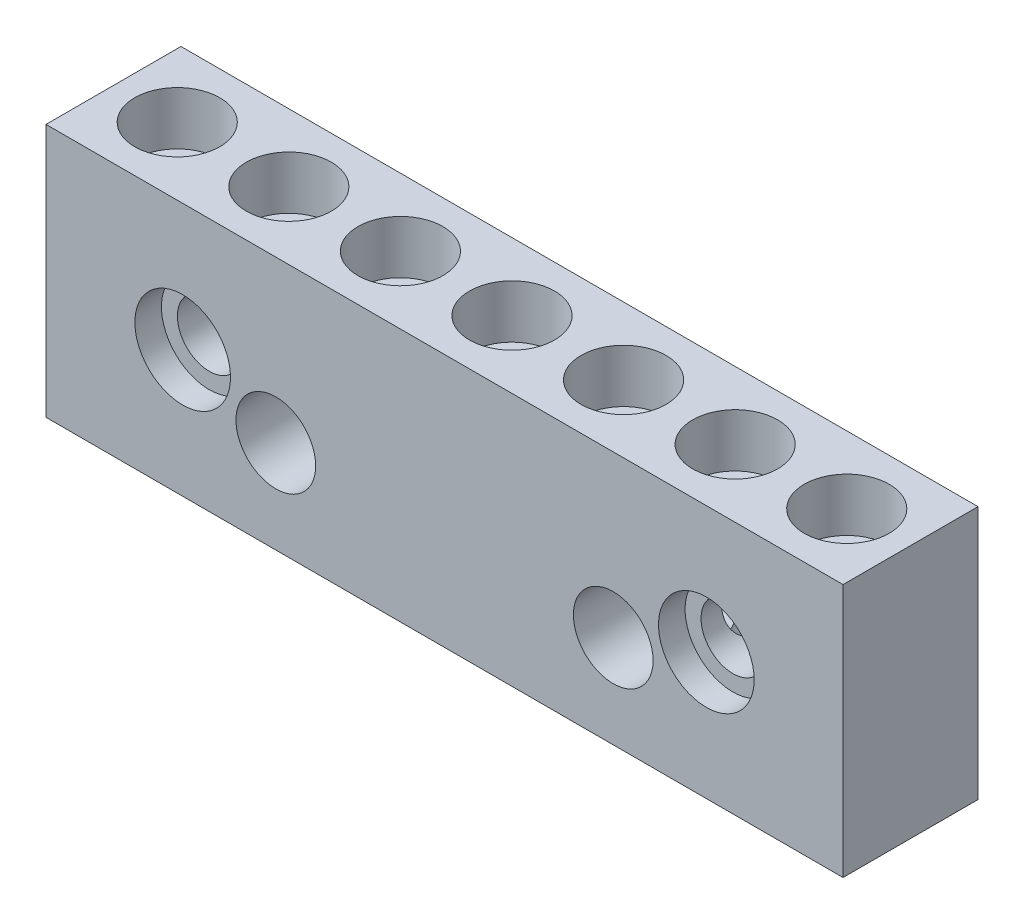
ISO-10303-21;
HEADER;
FILE_DESCRIPTION(('STEP AP214'),'2;1');
FILE_NAME('part.step','',(''),(''),'','','');
FILE_SCHEMA(('AUTOMOTIVE_DESIGN { 1 0 10303 214 1 1 1 1 }'));
ENDSEC;
DATA;
#1=APPLICATION_CONTEXT('core data for automotive mechanical design processes');
#2=APPLICATION_PROTOCOL_DEFINITION('international standard','automotive_design',2000,#1);
#3=PRODUCT_CONTEXT('',#1,'mechanical');
#4=PRODUCT('Part','Part','',(#3));
#5=PRODUCT_RELATED_PRODUCT_CATEGORY('part','',(#4));
#6=PRODUCT_DEFINITION_FORMATION('','',#4);
#7=PRODUCT_DEFINITION_CONTEXT('part definition',#1,'design');
#8=PRODUCT_DEFINITION('design','',#6,#7);
#9=PRODUCT_DEFINITION_SHAPE('','',#8);
#10=(LENGTH_UNIT() NAMED_UNIT(*) SI_UNIT(.MILLI.,.METRE.));
#11=(NAMED_UNIT(*) PLANE_ANGLE_UNIT() SI_UNIT($,.RADIAN.));
#12=(NAMED_UNIT(*) SI_UNIT($,.STERADIAN.) SOLID_ANGLE_UNIT());
#13=UNCERTAINTY_MEASURE_WITH_UNIT(LENGTH_MEASURE(1.E-05),#10,'distance_accuracy_value','');
#14=(GEOMETRIC_REPRESENTATION_CONTEXT(3) GLOBAL_UNCERTAINTY_ASSIGNED_CONTEXT((#13)) GLOBAL_UNIT_ASSIGNED_CONTEXT((#10,
#11,#12)) REPRESENTATION_CONTEXT('',''));
#15=CARTESIAN_POINT('',(0.,0.,0.));
#16=DIRECTION('',(0.,0.,1.));
#17=DIRECTION('',(1.,0.,0.));
#18=AXIS2_PLACEMENT_3D('',#15,#16,#17);
#19=CARTESIAN_POINT('',(-75.,-23.875,12.7));
#20=DIRECTION('',(1.,0.,0.));
#21=DIRECTION('',(0.,0.,-1.));
#22=AXIS2_PLACEMENT_3D('',#19,#20,#21);
#23=PLANE('',#22);
#24=DIRECTION('',(0.,-1.,0.));
#25=VECTOR('',#24,1.);
#26=CARTESIAN_POINT('',(-75.,-23.875,-12.7));
#27=LINE('',#26,#25);
#28=CARTESIAN_POINT('',(-75.,23.875,-12.7));
#29=VERTEX_POINT('',#28);
#30=CARTESIAN_POINT('',(-75.,-23.875,-12.7));
#31=VERTEX_POINT('',#30);
#32=EDGE_CURVE('E116',#29,#31,#27,.T.);
#33=ORIENTED_EDGE('',*,*,#32,.T.);
#34=DIRECTION('',(0.,0.,-1.));
#35=VECTOR('',#34,1.);
#36=CARTESIAN_POINT('',(-75.,-23.875,12.7));
#37=LINE('',#36,#35);
#38=CARTESIAN_POINT('',(-75.,-23.875,12.7));
#39=VERTEX_POINT('',#38);
#40=EDGE_CURVE('E11',#39,#31,#37,.T.);
#41=ORIENTED_EDGE('',*,*,#40,.F.);
#42=DIRECTION('',(0.,-1.,0.));
#43=VECTOR('',#42,1.);
#44=CARTESIAN_POINT('',(-75.,-23.875,12.7));
#45=LINE('',#44,#43);
#46=CARTESIAN_POINT('',(-75.,23.875,12.7));
#47=VERTEX_POINT('',#46);
#48=EDGE_CURVE('E97',#47,#39,#45,.T.);
#49=ORIENTED_EDGE('',*,*,#48,.F.);
#50=DIRECTION('',(0.,0.,-1.));
#51=VECTOR('',#50,1.);
#52=CARTESIAN_POINT('',(-75.,23.875,12.7));
#53=LINE('',#52,#51);
#54=EDGE_CURVE('E112',#47,#29,#53,.T.);
#55=ORIENTED_EDGE('',*,*,#54,.T.);
#56=EDGE_LOOP('',(#33,#41,#49,#55));
#57=FACE_BOUND('',#56,.T.);
#58=ADVANCED_FACE('F39',(#57),#23,.F.);
#59=CARTESIAN_POINT('',(75.,-23.875,12.7));
#60=DIRECTION('',(0.,1.,0.));
#61=DIRECTION('',(-1.,0.,0.));
#62=AXIS2_PLACEMENT_3D('',#59,#60,#61);
#63=PLANE('',#62);
#64=CARTESIAN_POINT('',(-42.,-23.875,0.));
#65=DIRECTION('',(0.,1.,0.));
#66=DIRECTION('',(-1.,0.,0.));
#67=AXIS2_PLACEMENT_3D('',#64,#65,#66);
#68=CIRCLE('',#67,4.00000000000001);
#69=CARTESIAN_POINT('',(-46.,-23.875,0.));
#70=VERTEX_POINT('',#69);
#71=EDGE_CURVE('E140',#70,#70,#68,.F.);
#72=ORIENTED_EDGE('',*,*,#71,.F.);
#73=EDGE_LOOP('',(#72));
#74=FACE_BOUND('',#73,.T.);
#75=CARTESIAN_POINT('',(-21.,-23.875,0.));
#76=DIRECTION('',(0.,1.,0.));
#77=DIRECTION('',(-1.,0.,0.));
#78=AXIS2_PLACEMENT_3D('',#75,#76,#77);
#79=CIRCLE('',#78,4.00000000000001);
#80=CARTESIAN_POINT('',(-25.,-23.875,0.));
#81=VERTEX_POINT('',#80);
#82=EDGE_CURVE('E328',#81,#81,#79,.F.);
#83=ORIENTED_EDGE('',*,*,#82,.F.);
#84=EDGE_LOOP('',(#83));
#85=FACE_BOUND('',#84,.T.);
#86=CARTESIAN_POINT('',(0.,-23.875,0.));
#87=DIRECTION('',(0.,1.,0.));
#88=DIRECTION('',(-1.,0.,0.));
#89=AXIS2_PLACEMENT_3D('',#86,#87,#88);
#90=CIRCLE('',#89,4.00000000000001);
#91=CARTESIAN_POINT('',(-3.99999999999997,-23.875,0.));
#92=VERTEX_POINT('',#91);
#93=EDGE_CURVE('E329',#92,#92,#90,.F.);
#94=ORIENTED_EDGE('',*,*,#93,.F.);
#95=EDGE_LOOP('',(#94));
#96=FACE_BOUND('',#95,.T.);
#97=CARTESIAN_POINT('',(21.,-23.875,0.));
#98=DIRECTION('',(0.,1.,0.));
#99=DIRECTION('',(-1.,0.,0.));
#100=AXIS2_PLACEMENT_3D('',#97,#98,#99);
#101=CIRCLE('',#100,4.00000000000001);
#102=CARTESIAN_POINT('',(17.,-23.875,0.));
#103=VERTEX_POINT('',#102);
#104=EDGE_CURVE('E230',#103,#103,#101,.F.);
#105=ORIENTED_EDGE('',*,*,#104,.F.);
#106=EDGE_LOOP('',(#105));
#107=FACE_BOUND('',#106,.T.);
#108=CARTESIAN_POINT('',(42.,-23.875,0.));
#109=DIRECTION('',(0.,1.,0.));
#110=DIRECTION('',(-1.,0.,0.));
#111=AXIS2_PLACEMENT_3D('',#108,#109,#110);
#112=CIRCLE('',#111,4.00000000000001);
#113=CARTESIAN_POINT('',(38.,-23.875,0.));
#114=VERTEX_POINT('',#113);
#115=EDGE_CURVE('E213',#114,#114,#112,.F.);
#116=ORIENTED_EDGE('',*,*,#115,.F.);
#117=EDGE_LOOP('',(#116));
#118=FACE_BOUND('',#117,.T.);
#119=CARTESIAN_POINT('',(63.,-23.875,0.));
#120=DIRECTION('',(0.,1.,0.));
#121=DIRECTION('',(-1.,0.,0.));
#122=AXIS2_PLACEMENT_3D('',#119,#120,#121);
#123=CIRCLE('',#122,4.00000000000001);
#124=CARTESIAN_POINT('',(59.,-23.875,0.));
#125=VERTEX_POINT('',#124);
#126=EDGE_CURVE('E168',#125,#125,#123,.F.);
#127=ORIENTED_EDGE('',*,*,#126,.F.);
#128=EDGE_LOOP('',(#127));
#129=FACE_BOUND('',#128,.T.);
#130=CARTESIAN_POINT('',(-63.,-23.875,0.));
#131=DIRECTION('',(0.,1.,0.));
#132=DIRECTION('',(-1.,0.,0.));
#133=AXIS2_PLACEMENT_3D('',#130,#131,#132);
#134=CIRCLE('',#133,4.00000000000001);
#135=CARTESIAN_POINT('',(-67.,-23.875,0.));
#136=VERTEX_POINT('',#135);
#137=EDGE_CURVE('E268',#136,#136,#134,.F.);
#138=ORIENTED_EDGE('',*,*,#137,.F.);
#139=EDGE_LOOP('',(#138));
#140=FACE_BOUND('',#139,.T.);
#141=DIRECTION('',(1.,0.,0.));
#142=VECTOR('',#141,1.);
#143=CARTESIAN_POINT('',(75.,-23.875,-12.7));
#144=LINE('',#143,#142);
#145=CARTESIAN_POINT('',(75.,-23.875,-12.7));
#146=VERTEX_POINT('',#145);
#147=EDGE_CURVE('E102',#31,#146,#144,.T.);
#148=ORIENTED_EDGE('',*,*,#147,.T.);
#149=DIRECTION('',(0.,0.,-1.));
#150=VECTOR('',#149,1.);
#151=CARTESIAN_POINT('',(75.,-23.875,12.7));
#152=LINE('',#151,#150);
#153=CARTESIAN_POINT('',(75.,-23.875,12.7));
#154=VERTEX_POINT('',#153);
#155=EDGE_CURVE('E53',#154,#146,#152,.T.);
#156=ORIENTED_EDGE('',*,*,#155,.F.);
#157=DIRECTION('',(1.,0.,0.));
#158=VECTOR('',#157,1.);
#159=CARTESIAN_POINT('',(75.,-23.875,12.7));
#160=LINE('',#159,#158);
#161=EDGE_CURVE('E92',#39,#154,#160,.T.);
#162=ORIENTED_EDGE('',*,*,#161,.F.);
#163=ORIENTED_EDGE('',*,*,#40,.T.);
#164=EDGE_LOOP('',(#148,#156,#162,#163));
#165=FACE_BOUND('',#164,.T.);
#166=ADVANCED_FACE('F101',(#74,#85,#96,#107,#118,#129,#140,#165),#63,.F.);
#167=CARTESIAN_POINT('',(75.,-23.875,12.7));
#168=DIRECTION('',(-1.,0.,0.));
#169=DIRECTION('',(0.,0.,1.));
#170=AXIS2_PLACEMENT_3D('',#167,#168,#169);
#171=PLANE('',#170);
#172=DIRECTION('',(0.,1.,0.));
#173=VECTOR('',#172,1.);
#174=CARTESIAN_POINT('',(75.,-23.875,-12.7));
#175=LINE('',#174,#173);
#176=CARTESIAN_POINT('',(75.,23.875,-12.7));
#177=VERTEX_POINT('',#176);
#178=EDGE_CURVE('E79',#146,#177,#175,.T.);
#179=ORIENTED_EDGE('',*,*,#178,.T.);
#180=DIRECTION('',(0.,0.,-1.));
#181=VECTOR('',#180,1.);
#182=CARTESIAN_POINT('',(75.,23.875,12.7));
#183=LINE('',#182,#181);
#184=CARTESIAN_POINT('',(75.,23.875,12.7));
#185=VERTEX_POINT('',#184);
#186=EDGE_CURVE('E104',#185,#177,#183,.T.);
#187=ORIENTED_EDGE('',*,*,#186,.F.);
#188=DIRECTION('',(0.,1.,0.));
#189=VECTOR('',#188,1.);
#190=CARTESIAN_POINT('',(75.,-23.875,12.7));
#191=LINE('',#190,#189);
#192=EDGE_CURVE('E95',#154,#185,#191,.T.);
#193=ORIENTED_EDGE('',*,*,#192,.F.);
#194=ORIENTED_EDGE('',*,*,#155,.T.);
#195=EDGE_LOOP('',(#179,#187,#193,#194));
#196=FACE_BOUND('',#195,.T.);
#197=ADVANCED_FACE('F106',(#196),#171,.F.);
#198=CARTESIAN_POINT('',(75.,23.875,12.7));
#199=DIRECTION('',(0.,-1.,0.));
#200=DIRECTION('',(1.,0.,0.));
#201=AXIS2_PLACEMENT_3D('',#198,#199,#200);
#202=PLANE('',#201);
#203=CARTESIAN_POINT('',(-42.,23.875,0.));
#204=DIRECTION('',(0.,1.,0.));
#205=DIRECTION('',(-1.,0.,0.));
#206=AXIS2_PLACEMENT_3D('',#203,#204,#205);
#207=CIRCLE('',#206,7.99999999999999);
#208=CARTESIAN_POINT('',(-50.,23.875,0.));
#209=VERTEX_POINT('',#208);
#210=EDGE_CURVE('E784',#209,#209,#207,.T.);
#211=ORIENTED_EDGE('',*,*,#210,.F.);
#212=EDGE_LOOP('',(#211));
#213=FACE_BOUND('',#212,.T.);
#214=CARTESIAN_POINT('',(-21.,23.875,0.));
#215=DIRECTION('',(0.,1.,0.));
#216=DIRECTION('',(-1.,0.,0.));
#217=AXIS2_PLACEMENT_3D('',#214,#215,#216);
#218=CIRCLE('',#217,7.99999999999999);
#219=CARTESIAN_POINT('',(-29.,23.875,0.));
#220=VERTEX_POINT('',#219);
#221=EDGE_CURVE('E738',#220,#220,#218,.T.);
#222=ORIENTED_EDGE('',*,*,#221,.F.);
#223=EDGE_LOOP('',(#222));
#224=FACE_BOUND('',#223,.T.);
#225=CARTESIAN_POINT('',(0.,23.875,0.));
#226=DIRECTION('',(0.,1.,0.));
#227=DIRECTION('',(-1.,0.,0.));
#228=AXIS2_PLACEMENT_3D('',#225,#226,#227);
#229=CIRCLE('',#228,7.99999999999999);
#230=CARTESIAN_POINT('',(-7.99999999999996,23.875,0.));
#231=VERTEX_POINT('',#230);
#232=EDGE_CURVE('E739',#231,#231,#229,.T.);
#233=ORIENTED_EDGE('',*,*,#232,.F.);
#234=EDGE_LOOP('',(#233));
#235=FACE_BOUND('',#234,.T.);
#236=CARTESIAN_POINT('',(21.,23.875,0.));
#237=DIRECTION('',(0.,1.,0.));
#238=DIRECTION('',(-1.,0.,0.));
#239=AXIS2_PLACEMENT_3D('',#236,#237,#238);
#240=CIRCLE('',#239,7.99999999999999);
#241=CARTESIAN_POINT('',(13.,23.875,0.));
#242=VERTEX_POINT('',#241);
#243=EDGE_CURVE('E753',#242,#242,#240,.T.);
#244=ORIENTED_EDGE('',*,*,#243,.F.);
#245=EDGE_LOOP('',(#244));
#246=FACE_BOUND('',#245,.T.);
#247=CARTESIAN_POINT('',(42.,23.875,0.));
#248=DIRECTION('',(0.,1.,0.));
#249=DIRECTION('',(-1.,0.,0.));
#250=AXIS2_PLACEMENT_3D('',#247,#248,#249);
#251=CIRCLE('',#250,7.99999999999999);
#252=CARTESIAN_POINT('',(34.,23.875,0.));
#253=VERTEX_POINT('',#252);
#254=EDGE_CURVE('E251',#253,#253,#251,.T.);
#255=ORIENTED_EDGE('',*,*,#254,.F.);
#256=EDGE_LOOP('',(#255));
#257=FACE_BOUND('',#256,.T.);
#258=CARTESIAN_POINT('',(63.,23.875,0.));
#259=DIRECTION('',(0.,1.,0.));
#260=DIRECTION('',(-1.,0.,0.));
#261=AXIS2_PLACEMENT_3D('',#258,#259,#260);
#262=CIRCLE('',#261,7.99999999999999);
#263=CARTESIAN_POINT('',(55.,23.875,0.));
#264=VERTEX_POINT('',#263);
#265=EDGE_CURVE('E195',#264,#264,#262,.T.);
#266=ORIENTED_EDGE('',*,*,#265,.F.);
#267=EDGE_LOOP('',(#266));
#268=FACE_BOUND('',#267,.T.);
#269=CARTESIAN_POINT('',(-63.,23.875,0.));
#270=DIRECTION('',(0.,1.,0.));
#271=DIRECTION('',(-1.,0.,0.));
#272=AXIS2_PLACEMENT_3D('',#269,#270,#271);
#273=CIRCLE('',#272,7.99999999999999);
#274=CARTESIAN_POINT('',(-71.,23.875,0.));
#275=VERTEX_POINT('',#274);
#276=EDGE_CURVE('E272',#275,#275,#273,.T.);
#277=ORIENTED_EDGE('',*,*,#276,.F.);
#278=EDGE_LOOP('',(#277));
#279=FACE_BOUND('',#278,.T.);
#280=DIRECTION('',(-1.,0.,0.));
#281=VECTOR('',#280,1.);
#282=CARTESIAN_POINT('',(75.,23.875,-12.7));
#283=LINE('',#282,#281);
#284=EDGE_CURVE('E85',#177,#29,#283,.T.);
#285=ORIENTED_EDGE('',*,*,#284,.T.);
#286=ORIENTED_EDGE('',*,*,#54,.F.);
#287=DIRECTION('',(-1.,0.,0.));
#288=VECTOR('',#287,1.);
#289=CARTESIAN_POINT('',(75.,23.875,12.7));
#290=LINE('',#289,#288);
#291=EDGE_CURVE('E62',#185,#47,#290,.T.);
#292=ORIENTED_EDGE('',*,*,#291,.F.);
#293=ORIENTED_EDGE('',*,*,#186,.T.);
#294=EDGE_LOOP('',(#285,#286,#292,#293));
#295=FACE_BOUND('',#294,.T.);
#296=ADVANCED_FACE('F378',(#213,#224,#235,#246,#257,#268,#279,#295),#202,.F.);
#297=CARTESIAN_POINT('',(0.,0.,12.7));
#298=DIRECTION('',(0.,0.,1.));
#299=DIRECTION('',(1.,0.,0.));
#300=AXIS2_PLACEMENT_3D('',#297,#298,#299);
#301=PLANE('',#300);
#302=CARTESIAN_POINT('',(-49.275,-0.00500000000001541,12.7));
#303=DIRECTION('',(0.,0.,1.));
#304=DIRECTION('',(1.,0.,0.));
#305=AXIS2_PLACEMENT_3D('',#302,#303,#304);
#306=CIRCLE('',#305,9.00000000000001);
#307=CARTESIAN_POINT('',(-40.275,-0.00500000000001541,12.7));
#308=VERTEX_POINT('',#307);
#309=EDGE_CURVE('E300',#308,#308,#306,.T.);
#310=ORIENTED_EDGE('',*,*,#309,.F.);
#311=EDGE_LOOP('',(#310));
#312=FACE_BOUND('',#311,.T.);
#313=CARTESIAN_POINT('',(49.275,-0.00500000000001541,12.7));
#314=DIRECTION('',(0.,0.,1.));
#315=DIRECTION('',(1.,0.,0.));
#316=AXIS2_PLACEMENT_3D('',#313,#314,#315);
#317=CIRCLE('',#316,9.);
#318=CARTESIAN_POINT('',(58.275,-0.00500000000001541,12.7));
#319=VERTEX_POINT('',#318);
#320=EDGE_CURVE('E288',#319,#319,#317,.T.);
#321=ORIENTED_EDGE('',*,*,#320,.F.);
#322=EDGE_LOOP('',(#321));
#323=FACE_BOUND('',#322,.T.);
#324=CARTESIAN_POINT('',(-31.75,-6.40500000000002,12.7));
#325=DIRECTION('',(0.,0.,1.));
#326=DIRECTION('',(1.,0.,0.));
#327=AXIS2_PLACEMENT_3D('',#324,#325,#326);
#328=CIRCLE('',#327,7.5);
#329=CARTESIAN_POINT('',(-24.25,-6.40500000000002,12.7));
#330=VERTEX_POINT('',#329);
#331=EDGE_CURVE('E311',#330,#330,#328,.T.);
#332=ORIENTED_EDGE('',*,*,#331,.F.);
#333=EDGE_LOOP('',(#332));
#334=FACE_BOUND('',#333,.T.);
#335=CARTESIAN_POINT('',(31.75,-6.40500000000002,12.7));
#336=DIRECTION('',(0.,0.,1.));
#337=DIRECTION('',(1.,0.,0.));
#338=AXIS2_PLACEMENT_3D('',#335,#336,#337);
#339=CIRCLE('',#338,7.50000000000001);
#340=CARTESIAN_POINT('',(39.25,-6.40500000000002,12.7));
#341=VERTEX_POINT('',#340);
#342=EDGE_CURVE('E299',#341,#341,#339,.T.);
#343=ORIENTED_EDGE('',*,*,#342,.F.);
#344=EDGE_LOOP('',(#343));
#345=FACE_BOUND('',#344,.T.);
#346=ORIENTED_EDGE('',*,*,#48,.T.);
#347=ORIENTED_EDGE('',*,*,#161,.T.);
#348=ORIENTED_EDGE('',*,*,#192,.T.);
#349=ORIENTED_EDGE('',*,*,#291,.T.);
#350=EDGE_LOOP('',(#346,#347,#348,#349));
#351=FACE_BOUND('',#350,.T.);
#352=ADVANCED_FACE('F93',(#312,#323,#334,#345,#351),#301,.T.);
#353=CARTESIAN_POINT('',(0.,0.,-12.7));
#354=DIRECTION('',(0.,0.,1.));
#355=DIRECTION('',(1.,0.,0.));
#356=AXIS2_PLACEMENT_3D('',#353,#354,#355);
#357=PLANE('',#356);
#358=CARTESIAN_POINT('',(-49.275,-0.00500000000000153,-12.7));
#359=DIRECTION('',(0.,0.,1.));
#360=DIRECTION('',(1.,0.,0.));
#361=AXIS2_PLACEMENT_3D('',#358,#359,#360);
#362=CIRCLE('',#361,6.);
#363=CARTESIAN_POINT('',(-43.275,-0.00500000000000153,-12.7));
#364=VERTEX_POINT('',#363);
#365=EDGE_CURVE('E284',#364,#364,#362,.F.);
#366=ORIENTED_EDGE('',*,*,#365,.F.);
#367=EDGE_LOOP('',(#366));
#368=FACE_BOUND('',#367,.T.);
#369=CARTESIAN_POINT('',(49.275,-0.00500000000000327,-12.7));
#370=DIRECTION('',(0.,0.,1.));
#371=DIRECTION('',(1.,0.,0.));
#372=AXIS2_PLACEMENT_3D('',#369,#370,#371);
#373=CIRCLE('',#372,6.);
#374=CARTESIAN_POINT('',(55.275,-0.00500000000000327,-12.7));
#375=VERTEX_POINT('',#374);
#376=EDGE_CURVE('E285',#375,#375,#373,.F.);
#377=ORIENTED_EDGE('',*,*,#376,.F.);
#378=EDGE_LOOP('',(#377));
#379=FACE_BOUND('',#378,.T.);
#380=CARTESIAN_POINT('',(-31.75,-6.40500000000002,-12.7));
#381=DIRECTION('',(0.,0.,1.));
#382=DIRECTION('',(1.,0.,0.));
#383=AXIS2_PLACEMENT_3D('',#380,#381,#382);
#384=CIRCLE('',#383,7.5);
#385=CARTESIAN_POINT('',(-24.25,-6.40500000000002,-12.7));
#386=VERTEX_POINT('',#385);
#387=EDGE_CURVE('E120',#386,#386,#384,.F.);
#388=ORIENTED_EDGE('',*,*,#387,.F.);
#389=EDGE_LOOP('',(#388));
#390=FACE_BOUND('',#389,.T.);
#391=CARTESIAN_POINT('',(31.75,-6.40500000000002,-12.7));
#392=DIRECTION('',(0.,0.,1.));
#393=DIRECTION('',(1.,0.,0.));
#394=AXIS2_PLACEMENT_3D('',#391,#392,#393);
#395=CIRCLE('',#394,7.50000000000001);
#396=CARTESIAN_POINT('',(39.25,-6.40500000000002,-12.7));
#397=VERTEX_POINT('',#396);
#398=EDGE_CURVE('E315',#397,#397,#395,.F.);
#399=ORIENTED_EDGE('',*,*,#398,.F.);
#400=EDGE_LOOP('',(#399));
#401=FACE_BOUND('',#400,.T.);
#402=ORIENTED_EDGE('',*,*,#32,.F.);
#403=ORIENTED_EDGE('',*,*,#284,.F.);
#404=ORIENTED_EDGE('',*,*,#178,.F.);
#405=ORIENTED_EDGE('',*,*,#147,.F.);
#406=EDGE_LOOP('',(#402,#403,#404,#405));
#407=FACE_BOUND('',#406,.T.);
#408=ADVANCED_FACE('F386',(#368,#379,#390,#401,#407),#357,.F.);
#409=CARTESIAN_POINT('',(31.75,-6.40500000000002,-33.9132034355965));
#410=DIRECTION('',(0.,0.,1.));
#411=DIRECTION('',(1.,0.,0.));
#412=AXIS2_PLACEMENT_3D('',#409,#410,#411);
#413=CYLINDRICAL_SURFACE('',#412,7.50000000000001);
#414=CARTESIAN_POINT('',(24.25,-6.40500000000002,-2.33184476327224));
#415=CARTESIAN_POINT('',(24.2500005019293,-6.51595788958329,-2.3318453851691));
#416=CARTESIAN_POINT('',(24.2524663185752,-6.62692998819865,-2.32841913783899));
#417=CARTESIAN_POINT('',(24.2622906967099,-6.84827125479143,-2.31463384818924));
#418=CARTESIAN_POINT('',(24.2696514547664,-6.95864012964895,-2.30427169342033));
#419=CARTESIAN_POINT('',(24.2891514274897,-7.17824672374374,-2.27635105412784));
#420=CARTESIAN_POINT('',(24.3012991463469,-7.28748207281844,-2.2587797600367));
#421=CARTESIAN_POINT('',(24.3301305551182,-7.50383498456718,-2.21605432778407));
#422=CARTESIAN_POINT('',(24.346812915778,-7.61095315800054,-2.19090241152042));
#423=CARTESIAN_POINT('',(24.3810446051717,-7.80368844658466,-2.13760448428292));
#424=CARTESIAN_POINT('',(24.3979294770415,-7.88978335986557,-2.11075595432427));
#425=CARTESIAN_POINT('',(24.4342224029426,-8.05936167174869,-2.05117877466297));
#426=CARTESIAN_POINT('',(24.4536299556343,-8.14284558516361,-2.01845129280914));
#427=CARTESIAN_POINT('',(24.494538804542,-8.30641362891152,-1.94676634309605));
#428=CARTESIAN_POINT('',(24.5160366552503,-8.38650305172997,-1.90781906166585));
#429=CARTESIAN_POINT('',(24.5606124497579,-8.54259259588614,-1.82327158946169));
#430=CARTESIAN_POINT('',(24.5836898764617,-8.61859404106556,-1.77767357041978));
#431=CARTESIAN_POINT('',(24.6419976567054,-8.80067044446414,-1.65600153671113));
#432=CARTESIAN_POINT('',(24.6777851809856,-8.9038453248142,-1.57575082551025));
#433=CARTESIAN_POINT('',(24.748521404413,-9.09567812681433,-1.399139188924));
#434=CARTESIAN_POINT('',(24.7834710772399,-9.18435367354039,-1.30279811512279));
#435=CARTESIAN_POINT('',(24.8431541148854,-9.32912651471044,-1.11276840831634));
#436=CARTESIAN_POINT('',(24.8686032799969,-9.3882105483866,-1.02159223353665));
#437=CARTESIAN_POINT('',(24.9142184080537,-9.4913050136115,-0.829809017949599));
#438=CARTESIAN_POINT('',(24.9343864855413,-9.53532148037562,-0.729205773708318));
#439=CARTESIAN_POINT('',(24.9674380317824,-9.60631526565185,-0.520261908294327));
#440=CARTESIAN_POINT('',(24.980276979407,-9.63318856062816,-0.411878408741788));
#441=CARTESIAN_POINT('',(24.9969421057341,-9.66791275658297,-0.191425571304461));
#442=CARTESIAN_POINT('',(25.000772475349,-9.6757725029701,-0.0793579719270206));
#443=CARTESIAN_POINT('',(24.9990584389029,-9.67222711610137,0.132612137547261));
#444=CARTESIAN_POINT('',(24.9944527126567,-9.66275106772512,0.232560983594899));
#445=CARTESIAN_POINT('',(24.9781283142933,-9.62867901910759,0.429218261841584));
#446=CARTESIAN_POINT('',(24.9664103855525,-9.60408459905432,0.525927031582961));
#447=CARTESIAN_POINT('',(24.9370073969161,-9.54097278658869,0.713422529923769));
#448=CARTESIAN_POINT('',(24.9193359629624,-9.50248717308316,0.804222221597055));
#449=CARTESIAN_POINT('',(24.8795243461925,-9.41314720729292,0.97841007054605));
#450=CARTESIAN_POINT('',(24.857382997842,-9.36228962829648,1.06179628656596));
#451=CARTESIAN_POINT('',(24.8075649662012,-9.24351739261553,1.22919999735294));
#452=CARTESIAN_POINT('',(24.7795448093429,-9.17431696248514,1.31219828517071));
#453=CARTESIAN_POINT('',(24.722102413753,-9.02512823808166,1.46724211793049));
#454=CARTESIAN_POINT('',(24.6926792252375,-8.94513256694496,1.53928010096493));
#455=CARTESIAN_POINT('',(24.6184255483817,-8.73082004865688,1.70869418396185));
#456=CARTESIAN_POINT('',(24.573877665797,-8.59054111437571,1.79867373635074));
#457=CARTESIAN_POINT('',(24.4906348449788,-8.29581772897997,1.95534586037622));
#458=CARTESIAN_POINT('',(24.4519542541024,-8.14133999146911,2.0219818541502));
#459=CARTESIAN_POINT('',(24.3953982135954,-7.87849357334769,2.11496514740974));
#460=CARTESIAN_POINT('',(24.3749589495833,-7.77270609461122,2.14727094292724));
#461=CARTESIAN_POINT('',(24.3383909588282,-7.55820228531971,2.20369826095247));
#462=CARTESIAN_POINT('',(24.3222635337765,-7.44948508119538,2.22781731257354));
#463=CARTESIAN_POINT('',(24.2946930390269,-7.23001173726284,2.26839061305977));
#464=CARTESIAN_POINT('',(24.283252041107,-7.11925471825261,2.28484147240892));
#465=CARTESIAN_POINT('',(24.2652881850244,-6.89650256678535,2.31044098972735));
#466=CARTESIAN_POINT('',(24.2587656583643,-6.78450735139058,2.31958915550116));
#467=CARTESIAN_POINT('',(24.2507049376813,-6.55843786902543,2.33087238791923));
#468=CARTESIAN_POINT('',(24.2492366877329,-6.44435622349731,2.33290904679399));
#469=CARTESIAN_POINT('',(24.2515064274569,-6.21633569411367,2.32974459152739));
#470=CARTESIAN_POINT('',(24.2552448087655,-6.1023968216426,2.32454293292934));
#471=CARTESIAN_POINT('',(24.2678574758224,-5.87541640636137,2.30677832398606));
#472=CARTESIAN_POINT('',(24.2767300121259,-5.76237457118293,2.29421788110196));
#473=CARTESIAN_POINT('',(24.2994373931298,-5.53791662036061,2.26144038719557));
#474=CARTESIAN_POINT('',(24.3132713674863,-5.42650022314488,2.24122467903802));
#475=CARTESIAN_POINT('',(24.3430454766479,-5.22355115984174,2.19650771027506));
#476=CARTESIAN_POINT('',(24.3583076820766,-5.13165780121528,2.1731879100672));
#477=CARTESIAN_POINT('',(24.3918673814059,-4.9502175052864,2.12042788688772));
#478=CARTESIAN_POINT('',(24.4101643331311,-4.86067015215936,2.09098875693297));
#479=CARTESIAN_POINT('',(24.4494108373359,-4.68467659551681,2.02559095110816));
#480=CARTESIAN_POINT('',(24.4703576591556,-4.5982273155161,1.98963897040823));
#481=CARTESIAN_POINT('',(24.5144081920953,-4.42918394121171,1.91075152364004));
#482=CARTESIAN_POINT('',(24.5375112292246,-4.34658865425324,1.86781823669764));
#483=CARTESIAN_POINT('',(24.5967568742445,-4.14747222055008,1.75197100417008));
#484=CARTESIAN_POINT('',(24.6338219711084,-4.03376387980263,1.67457487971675));
#485=CARTESIAN_POINT('',(24.7083876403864,-3.82073701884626,1.50220936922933));
#486=CARTESIAN_POINT('',(24.7458875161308,-3.72139820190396,1.40726521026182));
#487=CARTESIAN_POINT('',(24.8105760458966,-3.55885346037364,1.2195784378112));
#488=CARTESIAN_POINT('',(24.8383641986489,-3.49237101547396,1.12989516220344));
#489=CARTESIAN_POINT('',(24.8892570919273,-3.37443248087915,0.939855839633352));
#490=CARTESIAN_POINT('',(24.9123635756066,-3.32297079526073,0.839503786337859));
#491=CARTESIAN_POINT('',(24.9516135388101,-3.23731878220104,0.629463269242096));
#492=CARTESIAN_POINT('',(24.9677066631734,-3.20325306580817,0.519713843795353));
#493=CARTESIAN_POINT('',(24.9907007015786,-3.15498214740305,0.294996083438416));
#494=CARTESIAN_POINT('',(24.9976075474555,-3.14076412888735,0.180031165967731));
#495=CARTESIAN_POINT('',(25.0011208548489,-3.1335132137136,-0.0367478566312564));
#496=CARTESIAN_POINT('',(24.9988711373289,-3.1381279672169,-0.138472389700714));
#497=CARTESIAN_POINT('',(24.98683840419,-3.1631122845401,-0.339484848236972));
#498=CARTESIAN_POINT('',(24.977056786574,-3.1834789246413,-0.438773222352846));
#499=CARTESIAN_POINT('',(24.9512363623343,-3.23834649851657,-0.629951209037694));
#500=CARTESIAN_POINT('',(24.9353458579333,-3.27251333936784,-0.721958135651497));
#501=CARTESIAN_POINT('',(24.8986886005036,-3.35352467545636,-0.89912301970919));
#502=CARTESIAN_POINT('',(24.8779207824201,-3.40037194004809,-0.984279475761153));
#503=CARTESIAN_POINT('',(24.830880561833,-3.5102325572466,-1.15451740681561));
#504=CARTESIAN_POINT('',(24.8042675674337,-3.57438318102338,-1.23876665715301));
#505=CARTESIAN_POINT('',(24.7491133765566,-3.71367722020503,-1.39684263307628));
#506=CARTESIAN_POINT('',(24.7205710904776,-3.78882687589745,-1.47066339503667));
#507=CARTESIAN_POINT('',(24.6485366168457,-3.98930215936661,-1.64345983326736));
#508=CARTESIAN_POINT('',(24.6049590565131,-4.12045430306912,-1.73565753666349));
#509=CARTESIAN_POINT('',(24.5222688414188,-4.39729424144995,-1.89788381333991));
#510=CARTESIAN_POINT('',(24.4831690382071,-4.54302173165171,-1.96784955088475));
#511=CARTESIAN_POINT('',(24.4245903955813,-4.79290222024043,-2.06742698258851));
#512=CARTESIAN_POINT('',(24.4029560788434,-4.89437990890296,-2.10267544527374));
#513=CARTESIAN_POINT('',(24.3635633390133,-5.10056237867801,-2.16513605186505));
#514=CARTESIAN_POINT('',(24.3458065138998,-5.20526847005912,-2.19234488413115));
#515=CARTESIAN_POINT('',(24.3146174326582,-5.41681413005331,-2.23921836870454));
#516=CARTESIAN_POINT('',(24.3011793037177,-5.52365058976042,-2.25889327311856));
#517=CARTESIAN_POINT('',(24.2788638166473,-5.73880725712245,-2.29116524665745));
#518=CARTESIAN_POINT('',(24.2699843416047,-5.84712675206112,-2.30376560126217));
#519=CARTESIAN_POINT('',(24.2589845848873,-6.03046113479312,-2.31928331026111));
#520=CARTESIAN_POINT('',(24.2556175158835,-6.10525727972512,-2.32399860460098));
#521=CARTESIAN_POINT('',(24.2511252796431,-6.25503347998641,-2.33027880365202));
#522=CARTESIAN_POINT('',(24.249999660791,-6.33001349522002,-2.33184434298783));
#523=CARTESIAN_POINT('',(24.25,-6.40500000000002,-2.33184476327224));
#524=B_SPLINE_CURVE_WITH_KNOTS('',3,(#414,#415,#416,#417,#418,#419,#420,#421,#422,#423,#424,
#425,#426,#427,#428,#429,#430,#431,#432,#433,#434,#435,#436,#437,#438,#439,#440,#441,#442,#443,
#444,#445,#446,#447,#448,#449,#450,#451,#452,#453,#454,#455,#456,#457,#458,#459,#460,#461,#462,
#463,#464,#465,#466,#467,#468,#469,#470,#471,#472,#473,#474,#475,#476,#477,#478,#479,#480,#481,
#482,#483,#484,#485,#486,#487,#488,#489,#490,#491,#492,#493,#494,#495,#496,#497,#498,#499,#500,
#501,#502,#503,#504,#505,#506,#507,#508,#509,#510,#511,#512,#513,#514,#515,#516,#517,#518,#519,
#520,#521,#522,#523),.UNSPECIFIED.,.T.,.F.,(4,2,2,2,2,2,2,2,2,2,2,2,2,2,2,2,2,2,2,2,2,2,2,2,2,2,
2,2,2,2,2,2,2,2,2,2,2,2,2,2,2,2,2,2,2,2,2,2,2,2,2,2,2,2,4),(0.,0.332817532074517,
0.665784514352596,0.999345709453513,1.33280923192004,1.60782519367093,1.88278658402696,
2.15730219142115,2.43172835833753,2.83674870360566,3.24127299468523,3.5746654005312,
3.90792411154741,4.24318624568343,4.57829238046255,4.87834692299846,5.17837010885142,
5.47771123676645,5.77713051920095,6.1108053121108,6.44470928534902,6.95938421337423,
7.47529806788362,7.81235431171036,8.14951219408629,8.48681896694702,8.82414847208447,
9.16612777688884,9.50813280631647,9.85002136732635,10.1918499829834,10.4796799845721,
10.7674586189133,11.0549430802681,11.3423379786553,11.7681074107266,12.1932694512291,
12.5370239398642,12.880650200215,13.2267045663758,13.5725353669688,13.87657683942,
14.1805618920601,14.4775909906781,14.7746850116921,15.1010186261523,15.427538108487,
15.9231968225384,16.4202442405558,16.7486024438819,17.0770957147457,17.405140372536,
17.733032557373,17.9579994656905,18.182921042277),.UNSPECIFIED.);
#525=CARTESIAN_POINT('',(24.25,-6.40500000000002,-2.33184476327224));
#526=VERTEX_POINT('',#525);
#527=EDGE_CURVE('E42',#526,#526,#524,.T.);
#528=ORIENTED_EDGE('',*,*,#527,.T.);
#529=EDGE_LOOP('',(#528));
#530=FACE_BOUND('',#529,.T.);
#531=CARTESIAN_POINT('',(39.25,-6.40500000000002,-2.90473750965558));
#532=CARTESIAN_POINT('',(39.2500012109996,-6.23403639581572,-2.90473477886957));
#533=CARTESIAN_POINT('',(39.24414525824,-6.06308997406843,-2.89922691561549));
#534=CARTESIAN_POINT('',(39.220840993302,-5.72261198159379,-2.87689832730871));
#535=CARTESIAN_POINT('',(39.2033861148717,-5.55308126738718,-2.86007119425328));
#536=CARTESIAN_POINT('',(39.157292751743,-5.21725610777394,-2.81426199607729));
#537=CARTESIAN_POINT('',(39.1286578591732,-5.05096064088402,-2.78528383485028));
#538=CARTESIAN_POINT('',(39.0609878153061,-4.72353115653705,-2.71378723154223));
#539=CARTESIAN_POINT('',(39.0219609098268,-4.56239315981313,-2.67127951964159));
#540=CARTESIAN_POINT('',(38.9519419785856,-4.30930874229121,-2.59055089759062));
#541=CARTESIAN_POINT('',(38.9237978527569,-4.21500170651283,-2.55718216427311));
#542=CARTESIAN_POINT('',(38.8646102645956,-4.02976078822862,-2.48425872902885));
#543=CARTESIAN_POINT('',(38.8335676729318,-3.93882590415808,-2.44470588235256));
#544=CARTESIAN_POINT('',(38.7691958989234,-3.76117804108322,-2.35897667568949));
#545=CARTESIAN_POINT('',(38.735870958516,-3.67445771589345,-2.31281243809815));
#546=CARTESIAN_POINT('',(38.66762490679,-3.50590617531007,-2.21334854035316));
#547=CARTESIAN_POINT('',(38.6327041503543,-3.42407388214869,-2.16005046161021));
#548=CARTESIAN_POINT('',(38.5422525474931,-3.22168507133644,-2.01370318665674));
#549=CARTESIAN_POINT('',(38.4861777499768,-3.10523865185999,-1.91515791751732));
#550=CARTESIAN_POINT('',(38.3766315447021,-2.89041415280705,-1.69877469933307));
#551=CARTESIAN_POINT('',(38.3231576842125,-2.79201879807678,-1.58095540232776));
#552=CARTESIAN_POINT('',(38.2318170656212,-2.63097468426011,-1.34685209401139));
#553=CARTESIAN_POINT('',(38.1928174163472,-2.56514183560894,-1.23321112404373));
#554=CARTESIAN_POINT('',(38.1236761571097,-2.45143192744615,-0.994731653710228));
#555=CARTESIAN_POINT('',(38.0935315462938,-2.4035487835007,-0.869896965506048));
#556=CARTESIAN_POINT('',(38.0448341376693,-2.32736010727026,-0.611557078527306));
#557=CARTESIAN_POINT('',(38.0263334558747,-2.29914253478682,-0.478015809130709));
#558=CARTESIAN_POINT('',(38.0030476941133,-2.26376052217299,-0.206991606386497));
#559=CARTESIAN_POINT('',(37.9982592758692,-2.25659095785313,-0.0695096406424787));
#560=CARTESIAN_POINT('',(38.0026950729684,-2.26328574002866,0.193550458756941));
#561=CARTESIAN_POINT('',(38.0108195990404,-2.27549926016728,0.319193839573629));
#562=CARTESIAN_POINT('',(38.0383261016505,-2.31750967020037,0.566196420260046));
#563=CARTESIAN_POINT('',(38.0577063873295,-2.34730391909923,0.687556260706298));
#564=CARTESIAN_POINT('',(38.1061179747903,-2.42356973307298,0.923142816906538));
#565=CARTESIAN_POINT('',(38.1351710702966,-2.47007897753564,1.03735272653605));
#566=CARTESIAN_POINT('',(38.2005970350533,-2.5782809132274,1.25601804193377));
#567=CARTESIAN_POINT('',(38.2369715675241,-2.63997705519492,1.36047122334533));
#568=CARTESIAN_POINT('',(38.3180986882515,-2.78319739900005,1.56751838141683));
#569=CARTESIAN_POINT('',(38.3633177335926,-2.8660420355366,1.6690100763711));
#570=CARTESIAN_POINT('',(38.4561356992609,-3.04525082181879,1.85799304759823));
#571=CARTESIAN_POINT('',(38.5037360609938,-3.14162322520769,1.94547570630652));
#572=CARTESIAN_POINT('',(38.5866238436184,-3.31992151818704,2.08657300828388));
#573=CARTESIAN_POINT('',(38.6220225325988,-3.39945944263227,2.14319388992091));
#574=CARTESIAN_POINT('',(38.6915907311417,-3.56382450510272,2.24909849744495));
#575=CARTESIAN_POINT('',(38.7257597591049,-3.64865368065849,2.2983793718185));
#576=CARTESIAN_POINT('',(38.7921081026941,-3.8228652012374,2.39011323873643));
#577=CARTESIAN_POINT('',(38.8242837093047,-3.91225550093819,2.43255372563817));
#578=CARTESIAN_POINT('',(38.8859543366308,-4.09471059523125,2.51101730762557));
#579=CARTESIAN_POINT('',(38.9154486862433,-4.18777630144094,2.54703879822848));
#580=CARTESIAN_POINT('',(38.9801327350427,-4.40698824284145,2.62367375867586));
#581=CARTESIAN_POINT('',(39.0141523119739,-4.53424559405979,2.66210672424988));
#582=CARTESIAN_POINT('',(39.075855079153,-4.79269765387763,2.72973779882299));
#583=CARTESIAN_POINT('',(39.1035362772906,-4.92389358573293,2.75893300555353));
#584=CARTESIAN_POINT('',(39.1520255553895,-5.18918316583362,2.80895978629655));
#585=CARTESIAN_POINT('',(39.1728299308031,-5.32327833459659,2.82978685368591));
#586=CARTESIAN_POINT('',(39.2071936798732,-5.59333915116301,2.86370639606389));
#587=CARTESIAN_POINT('',(39.220753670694,-5.72930463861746,2.87679952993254));
#588=CARTESIAN_POINT('',(39.2405903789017,-6.00450335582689,2.8958333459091));
#589=CARTESIAN_POINT('',(39.2467445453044,-6.1437536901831,2.90165373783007));
#590=CARTESIAN_POINT('',(39.2512749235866,-6.42250051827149,2.90594561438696));
#591=CARTESIAN_POINT('',(39.2496506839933,-6.56199702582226,2.90441667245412));
#592=CARTESIAN_POINT('',(39.2386473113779,-6.84039068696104,2.89395732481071));
#593=CARTESIAN_POINT('',(39.229269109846,-6.97928791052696,2.88502780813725));
#594=CARTESIAN_POINT('',(39.2028969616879,-7.25563889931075,2.85946741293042));
#595=CARTESIAN_POINT('',(39.1859038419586,-7.39309281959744,2.84283737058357));
#596=CARTESIAN_POINT('',(39.1465953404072,-7.65233739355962,2.80335102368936));
#597=CARTESIAN_POINT('',(39.1249608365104,-7.77434800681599,2.78126032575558));
#598=CARTESIAN_POINT('',(39.0760388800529,-8.01568678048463,2.72978274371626));
#599=CARTESIAN_POINT('',(39.0487511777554,-8.13501482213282,2.70039553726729));
#600=CARTESIAN_POINT('',(38.9890282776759,-8.36997753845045,2.63363916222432));
#601=CARTESIAN_POINT('',(38.9565985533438,-8.48561598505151,2.5962784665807));
#602=CARTESIAN_POINT('',(38.8872771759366,-8.71223417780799,2.51274629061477));
#603=CARTESIAN_POINT('',(38.8503870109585,-8.82321546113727,2.46657774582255));
#604=CARTESIAN_POINT('',(38.7549413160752,-9.08997188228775,2.34061508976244));
#605=CARTESIAN_POINT('',(38.6943195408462,-9.24243370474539,2.25519125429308));
#606=CARTESIAN_POINT('',(38.5697662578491,-9.52994352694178,2.0607628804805));
#607=CARTESIAN_POINT('',(38.5058399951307,-9.66501800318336,1.95179488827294));
#608=CARTESIAN_POINT('',(38.3929397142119,-9.8883774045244,1.73241061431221));
#609=CARTESIAN_POINT('',(38.3434621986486,-9.9806607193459,1.626337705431));
#610=CARTESIAN_POINT('',(38.2503789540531,-10.1472162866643,1.39836247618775));
#611=CARTESIAN_POINT('',(38.2067714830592,-10.2214938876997,1.27646487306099));
#612=CARTESIAN_POINT('',(38.1488397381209,-10.3173225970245,1.08313003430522));
#613=CARTESIAN_POINT('',(38.1307148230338,-10.3467590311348,1.0166314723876));
#614=CARTESIAN_POINT('',(38.097529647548,-10.3999778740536,0.880686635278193));
#615=CARTESIAN_POINT('',(38.0824678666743,-10.4237630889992,0.811241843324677));
#616=CARTESIAN_POINT('',(38.0558489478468,-10.46540444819,0.669952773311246));
#617=CARTESIAN_POINT('',(38.044291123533,-10.4832617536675,0.598108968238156));
#618=CARTESIAN_POINT('',(38.0250205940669,-10.5128486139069,0.452692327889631));
#619=CARTESIAN_POINT('',(38.0173073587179,-10.5245790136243,0.379119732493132));
#620=CARTESIAN_POINT('',(38.001749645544,-10.5481881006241,0.175468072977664));
#621=CARTESIAN_POINT('',(37.9981110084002,-10.5536321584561,0.044232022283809));
#622=CARTESIAN_POINT('',(38.0037594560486,-10.545109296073,-0.217217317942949));
#623=CARTESIAN_POINT('',(38.0130419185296,-10.5311493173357,-0.347430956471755));
#624=CARTESIAN_POINT('',(38.0428967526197,-10.4854582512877,-0.596986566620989));
#625=CARTESIAN_POINT('',(38.0629244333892,-10.4545831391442,-0.716552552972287));
#626=CARTESIAN_POINT('',(38.1122139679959,-10.3766927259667,-0.94824201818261));
#627=CARTESIAN_POINT('',(38.1414763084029,-10.3296765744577,-1.06036510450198));
#628=CARTESIAN_POINT('',(38.2086994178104,-10.2180874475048,-1.28062277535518));
#629=CARTESIAN_POINT('',(38.2470364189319,-10.1527218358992,-1.38823831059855));
#630=CARTESIAN_POINT('',(38.3285266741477,-10.0077645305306,-1.59131478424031));
#631=CARTESIAN_POINT('',(38.3716821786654,-9.92816617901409,-1.68676999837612));
#632=CARTESIAN_POINT('',(38.4782663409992,-9.72145287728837,-1.90188783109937));
#633=CARTESIAN_POINT('',(38.5427031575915,-9.58829492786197,-2.01525339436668));
#634=CARTESIAN_POINT('',(38.6690239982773,-9.30352541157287,-2.21787218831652));
#635=CARTESIAN_POINT('',(38.7309018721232,-9.15187249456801,-2.30706989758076));
#636=CARTESIAN_POINT('',(38.8279785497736,-8.88793926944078,-2.43772328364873));
#637=CARTESIAN_POINT('',(38.8652164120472,-8.77929438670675,-2.48519920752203));
#638=CARTESIAN_POINT('',(38.9355048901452,-8.55722416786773,-2.57137509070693));
#639=CARTESIAN_POINT('',(38.9685539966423,-8.44379712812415,-2.61007189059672));
#640=CARTESIAN_POINT('',(39.0297263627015,-8.21326234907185,-2.67948020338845));
#641=CARTESIAN_POINT('',(39.0578498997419,-8.09615481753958,-2.71019216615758));
#642=CARTESIAN_POINT('',(39.1086756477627,-7.85916366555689,-2.76434670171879));
#643=CARTESIAN_POINT('',(39.1313787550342,-7.73928050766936,-2.78779047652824));
#644=CARTESIAN_POINT('',(39.1837409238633,-7.41983817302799,-2.84093120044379));
#645=CARTESIAN_POINT('',(39.208518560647,-7.21850421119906,-2.86499102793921));
#646=CARTESIAN_POINT('',(39.2416542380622,-6.81310676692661,-2.8969025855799));
#647=CARTESIAN_POINT('',(39.2499985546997,-6.60904114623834,-2.90474076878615));
#648=CARTESIAN_POINT('',(39.25,-6.40500000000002,-2.90473750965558));
#649=B_SPLINE_CURVE_WITH_KNOTS('',3,(#531,#532,#533,#534,#535,#536,#537,#538,#539,#540,#541,
#542,#543,#544,#545,#546,#547,#548,#549,#550,#551,#552,#553,#554,#555,#556,#557,#558,#559,#560,
#561,#562,#563,#564,#565,#566,#567,#568,#569,#570,#571,#572,#573,#574,#575,#576,#577,#578,#579,
#580,#581,#582,#583,#584,#585,#586,#587,#588,#589,#590,#591,#592,#593,#594,#595,#596,#597,#598,
#599,#600,#601,#602,#603,#604,#605,#606,#607,#608,#609,#610,#611,#612,#613,#614,#615,#616,#617,
#618,#619,#620,#621,#622,#623,#624,#625,#626,#627,#628,#629,#630,#631,#632,#633,#634,#635,#636,
#637,#638,#639,#640,#641,#642,#643,#644,#645,#646,#647,#648),.UNSPECIFIED.,.T.,.F.,(4,2,2,2,2,2,
2,2,2,2,2,2,2,2,2,2,2,2,2,2,2,2,2,2,2,2,2,2,2,2,2,2,2,2,2,2,2,2,2,2,2,2,2,2,2,2,2,2,2,2,2,2,2,2,
2,2,2,2,4),(0.,0.512671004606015,1.02563248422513,1.53842928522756,2.05082040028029,
2.36234188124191,2.67377008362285,2.98463440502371,3.2954299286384,3.78104924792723,
4.26620136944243,4.67545939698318,5.08457857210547,5.49551610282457,5.90635358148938,
6.28403479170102,6.66165928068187,7.04014041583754,7.41870762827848,7.83294052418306,
8.24742726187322,8.55858382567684,8.86986095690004,9.18170086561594,9.49361861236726,
9.90469412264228,10.3158986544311,10.7273243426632,11.138714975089,11.5568235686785,
11.9749564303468,12.3930390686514,12.8110763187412,13.1883347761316,13.5656099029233,
13.9424861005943,14.3192369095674,14.8721109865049,15.4241329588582,15.86955248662,
16.3148395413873,16.5394017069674,16.7638521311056,16.9882585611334,17.2126340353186,
17.6046145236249,17.9964548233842,18.3700861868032,18.7437372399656,19.1370195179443,
19.5304862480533,20.0865484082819,20.6438773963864,21.0162518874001,21.38876017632,
21.7612474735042,22.1336731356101,22.7450238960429,23.3568849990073),.UNSPECIFIED.);
#650=CARTESIAN_POINT('',(39.25,-6.40500000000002,-2.90473750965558));
#651=VERTEX_POINT('',#650);
#652=EDGE_CURVE('E170',#651,#651,#649,.T.);
#653=ORIENTED_EDGE('',*,*,#652,.T.);
#654=EDGE_LOOP('',(#653));
#655=FACE_BOUND('',#654,.T.);
#656=ORIENTED_EDGE('',*,*,#398,.T.);
#657=EDGE_LOOP('',(#656));
#658=FACE_BOUND('',#657,.T.);
#659=ORIENTED_EDGE('',*,*,#342,.T.);
#660=EDGE_LOOP('',(#659));
#661=FACE_BOUND('',#660,.T.);
#662=ADVANCED_FACE('F179',(#530,#655,#658,#661),#413,.F.);
#663=CARTESIAN_POINT('',(-31.75,-6.40500000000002,-33.9132034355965));
#664=DIRECTION('',(0.,0.,1.));
#665=DIRECTION('',(1.,0.,0.));
#666=AXIS2_PLACEMENT_3D('',#663,#664,#665);
#667=CYLINDRICAL_SURFACE('',#666,7.5);
#668=CARTESIAN_POINT('',(-39.25,-6.40500000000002,-2.90473750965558));
#669=CARTESIAN_POINT('',(-39.2500012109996,-6.57596360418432,-2.90473477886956));
#670=CARTESIAN_POINT('',(-39.24414525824,-6.74691002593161,-2.8992269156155));
#671=CARTESIAN_POINT('',(-39.220840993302,-7.08738801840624,-2.87689832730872));
#672=CARTESIAN_POINT('',(-39.2033861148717,-7.25691873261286,-2.86007119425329));
#673=CARTESIAN_POINT('',(-39.157292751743,-7.5927438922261,-2.8142619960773));
#674=CARTESIAN_POINT('',(-39.1286578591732,-7.75903935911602,-2.78528383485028));
#675=CARTESIAN_POINT('',(-39.060987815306,-8.08646884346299,-2.71378723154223));
#676=CARTESIAN_POINT('',(-39.0219609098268,-8.24760684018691,-2.6712795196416));
#677=CARTESIAN_POINT('',(-38.9519419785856,-8.50069125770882,-2.59055089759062));
#678=CARTESIAN_POINT('',(-38.9237978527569,-8.59499829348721,-2.55718216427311));
#679=CARTESIAN_POINT('',(-38.8646102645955,-8.78023921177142,-2.48425872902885));
#680=CARTESIAN_POINT('',(-38.8335676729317,-8.87117409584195,-2.44470588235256));
#681=CARTESIAN_POINT('',(-38.7691958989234,-9.04882195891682,-2.3589766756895));
#682=CARTESIAN_POINT('',(-38.7358709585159,-9.13554228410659,-2.31281243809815));
#683=CARTESIAN_POINT('',(-38.6676249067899,-9.30409382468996,-2.21334854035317));
#684=CARTESIAN_POINT('',(-38.6327041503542,-9.38592611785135,-2.16005046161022));
#685=CARTESIAN_POINT('',(-38.542252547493,-9.5883149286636,-2.01370318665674));
#686=CARTESIAN_POINT('',(-38.4861777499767,-9.70476134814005,-1.91515791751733));
#687=CARTESIAN_POINT('',(-38.376631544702,-9.91958584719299,-1.69877469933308));
#688=CARTESIAN_POINT('',(-38.3231576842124,-10.0179812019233,-1.58095540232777));
#689=CARTESIAN_POINT('',(-38.2318170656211,-10.1790253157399,-1.3468520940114));
#690=CARTESIAN_POINT('',(-38.1928174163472,-10.2448581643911,-1.23321112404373));
#691=CARTESIAN_POINT('',(-38.1236761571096,-10.3585680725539,-0.994731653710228));
#692=CARTESIAN_POINT('',(-38.0935315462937,-10.4064512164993,-0.869896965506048));
#693=CARTESIAN_POINT('',(-38.0448341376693,-10.4826398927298,-0.611557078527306));
#694=CARTESIAN_POINT('',(-38.0263334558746,-10.5108574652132,-0.478015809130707));
#695=CARTESIAN_POINT('',(-38.0030476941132,-10.546239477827,-0.206991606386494));
#696=CARTESIAN_POINT('',(-37.9982592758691,-10.5534090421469,-0.0695096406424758));
#697=CARTESIAN_POINT('',(-38.0026950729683,-10.5467142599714,0.193550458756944));
#698=CARTESIAN_POINT('',(-38.0108195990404,-10.5345007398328,0.319193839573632));
#699=CARTESIAN_POINT('',(-38.0383261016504,-10.4924903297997,0.566196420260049));
#700=CARTESIAN_POINT('',(-38.0577063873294,-10.4626960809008,0.687556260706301));
#701=CARTESIAN_POINT('',(-38.1061179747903,-10.3864302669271,0.923142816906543));
#702=CARTESIAN_POINT('',(-38.1351710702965,-10.3399210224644,1.03735272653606));
#703=CARTESIAN_POINT('',(-38.2005970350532,-10.2317190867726,1.25601804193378));
#704=CARTESIAN_POINT('',(-38.236971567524,-10.1700229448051,1.36047122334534));
#705=CARTESIAN_POINT('',(-38.3180986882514,-10.026802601,1.56751838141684));
#706=CARTESIAN_POINT('',(-38.3633177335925,-9.94395796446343,1.6690100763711));
#707=CARTESIAN_POINT('',(-38.4561356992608,-9.76474917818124,1.85799304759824));
#708=CARTESIAN_POINT('',(-38.5037360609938,-9.66837677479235,1.94547570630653));
#709=CARTESIAN_POINT('',(-38.5866238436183,-9.49007848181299,2.08657300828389));
#710=CARTESIAN_POINT('',(-38.6220225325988,-9.41054055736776,2.14319388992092));
#711=CARTESIAN_POINT('',(-38.6915907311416,-9.24617549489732,2.24909849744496));
#712=CARTESIAN_POINT('',(-38.7257597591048,-9.16134631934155,2.29837937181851));
#713=CARTESIAN_POINT('',(-38.792108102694,-8.98713479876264,2.39011323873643));
#714=CARTESIAN_POINT('',(-38.8242837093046,-8.89774449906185,2.43255372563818));
#715=CARTESIAN_POINT('',(-38.8859543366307,-8.71528940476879,2.51101730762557));
#716=CARTESIAN_POINT('',(-38.9154486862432,-8.6222236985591,2.54703879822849));
#717=CARTESIAN_POINT('',(-38.9801327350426,-8.40301175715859,2.62367375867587));
#718=CARTESIAN_POINT('',(-39.0141523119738,-8.27575440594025,2.66210672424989));
#719=CARTESIAN_POINT('',(-39.075855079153,-8.01730234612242,2.72973779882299));
#720=CARTESIAN_POINT('',(-39.1035362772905,-7.88610641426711,2.75893300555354));
#721=CARTESIAN_POINT('',(-39.1520255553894,-7.62081683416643,2.80895978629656));
#722=CARTESIAN_POINT('',(-39.172829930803,-7.48672166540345,2.82978685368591));
#723=CARTESIAN_POINT('',(-39.2071936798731,-7.21666084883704,2.8637063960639));
#724=CARTESIAN_POINT('',(-39.220753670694,-7.08069536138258,2.87679952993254));
#725=CARTESIAN_POINT('',(-39.2405903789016,-6.80549664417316,2.8958333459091));
#726=CARTESIAN_POINT('',(-39.2467445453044,-6.66624630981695,2.90165373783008));
#727=CARTESIAN_POINT('',(-39.2512749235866,-6.38749948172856,2.90594561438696));
#728=CARTESIAN_POINT('',(-39.2496506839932,-6.24800297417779,2.90441667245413));
#729=CARTESIAN_POINT('',(-39.2386473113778,-5.96960931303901,2.89395732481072));
#730=CARTESIAN_POINT('',(-39.229269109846,-5.83071208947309,2.88502780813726));
#731=CARTESIAN_POINT('',(-39.2028969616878,-5.55436110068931,2.85946741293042));
#732=CARTESIAN_POINT('',(-39.1859038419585,-5.41690718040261,2.84283737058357));
#733=CARTESIAN_POINT('',(-39.1465953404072,-5.15766260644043,2.80335102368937));
#734=CARTESIAN_POINT('',(-39.1249608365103,-5.03565199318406,2.78126032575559));
#735=CARTESIAN_POINT('',(-39.0760388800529,-4.79431321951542,2.72978274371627));
#736=CARTESIAN_POINT('',(-39.0487511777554,-4.67498517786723,2.7003955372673));
#737=CARTESIAN_POINT('',(-38.9890282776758,-4.44002246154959,2.63363916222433));
#738=CARTESIAN_POINT('',(-38.9565985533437,-4.32438401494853,2.59627846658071));
#739=CARTESIAN_POINT('',(-38.8872771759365,-4.09776582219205,2.51274629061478));
#740=CARTESIAN_POINT('',(-38.8503870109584,-3.98678453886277,2.46657774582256));
#741=CARTESIAN_POINT('',(-38.7549413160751,-3.72002811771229,2.34061508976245));
#742=CARTESIAN_POINT('',(-38.6943195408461,-3.56756629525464,2.25519125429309));
#743=CARTESIAN_POINT('',(-38.569766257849,-3.28005647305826,2.06076288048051));
#744=CARTESIAN_POINT('',(-38.5058399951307,-3.14498199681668,1.95179488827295));
#745=CARTESIAN_POINT('',(-38.3929397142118,-2.92162259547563,1.73241061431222));
#746=CARTESIAN_POINT('',(-38.3434621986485,-2.82933928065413,1.62633770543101));
#747=CARTESIAN_POINT('',(-38.2503789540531,-2.66278371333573,1.39836247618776));
#748=CARTESIAN_POINT('',(-38.2067714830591,-2.58850611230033,1.276464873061));
#749=CARTESIAN_POINT('',(-38.1488397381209,-2.49267740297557,1.08313003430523));
#750=CARTESIAN_POINT('',(-38.1307148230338,-2.46324096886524,1.01663147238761));
#751=CARTESIAN_POINT('',(-38.097529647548,-2.41002212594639,0.880686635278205));
#752=CARTESIAN_POINT('',(-38.0824678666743,-2.38623691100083,0.811241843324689));
#753=CARTESIAN_POINT('',(-38.0558489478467,-2.34459555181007,0.669952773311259));
#754=CARTESIAN_POINT('',(-38.0442911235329,-2.32673824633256,0.598108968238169));
#755=CARTESIAN_POINT('',(-38.0250205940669,-2.29715138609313,0.452692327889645));
#756=CARTESIAN_POINT('',(-38.0173073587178,-2.28542098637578,0.379119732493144));
#757=CARTESIAN_POINT('',(-38.0017496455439,-2.2618118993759,0.175468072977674));
#758=CARTESIAN_POINT('',(-37.9981110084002,-2.25636784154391,0.0442320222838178));
#759=CARTESIAN_POINT('',(-38.0037594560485,-2.26489070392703,-0.21721731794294));
#760=CARTESIAN_POINT('',(-38.0130419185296,-2.27885068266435,-0.347430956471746));
#761=CARTESIAN_POINT('',(-38.0428967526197,-2.3245417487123,-0.59698656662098));
#762=CARTESIAN_POINT('',(-38.0629244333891,-2.35541686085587,-0.71655255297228));
#763=CARTESIAN_POINT('',(-38.1122139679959,-2.43330727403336,-0.948242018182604));
#764=CARTESIAN_POINT('',(-38.1414763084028,-2.4803234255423,-1.06036510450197));
#765=CARTESIAN_POINT('',(-38.2086994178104,-2.59191255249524,-1.28062277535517));
#766=CARTESIAN_POINT('',(-38.2470364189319,-2.65727816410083,-1.38823831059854));
#767=CARTESIAN_POINT('',(-38.3285266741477,-2.80223546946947,-1.5913147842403));
#768=CARTESIAN_POINT('',(-38.3716821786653,-2.88183382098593,-1.68676999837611));
#769=CARTESIAN_POINT('',(-38.4782663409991,-3.08854712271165,-1.90188783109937));
#770=CARTESIAN_POINT('',(-38.5427031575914,-3.22170507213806,-2.01525339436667));
#771=CARTESIAN_POINT('',(-38.6690239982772,-3.50647458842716,-2.21787218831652));
#772=CARTESIAN_POINT('',(-38.7309018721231,-3.65812750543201,-2.30706989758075));
#773=CARTESIAN_POINT('',(-38.8279785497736,-3.92206073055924,-2.43772328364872));
#774=CARTESIAN_POINT('',(-38.8652164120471,-4.03070561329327,-2.48519920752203));
#775=CARTESIAN_POINT('',(-38.9355048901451,-4.25277583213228,-2.57137509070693));
#776=CARTESIAN_POINT('',(-38.9685539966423,-4.36620287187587,-2.61007189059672));
#777=CARTESIAN_POINT('',(-39.0297263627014,-4.59673765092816,-2.67948020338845));
#778=CARTESIAN_POINT('',(-39.0578498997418,-4.71384518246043,-2.71019216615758));
#779=CARTESIAN_POINT('',(-39.1086756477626,-4.95083633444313,-2.76434670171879));
#780=CARTESIAN_POINT('',(-39.1313787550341,-5.07071949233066,-2.78779047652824));
#781=CARTESIAN_POINT('',(-39.1837409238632,-5.39016182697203,-2.8409312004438));
#782=CARTESIAN_POINT('',(-39.208518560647,-5.59149578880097,-2.86499102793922));
#783=CARTESIAN_POINT('',(-39.2416542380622,-5.99689323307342,-2.8969025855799));
#784=CARTESIAN_POINT('',(-39.2499985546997,-6.20095885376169,-2.90474076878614));
#785=CARTESIAN_POINT('',(-39.25,-6.40500000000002,-2.90473750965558));
#786=B_SPLINE_CURVE_WITH_KNOTS('',3,(#668,#669,#670,#671,#672,#673,#674,#675,#676,#677,#678,
#679,#680,#681,#682,#683,#684,#685,#686,#687,#688,#689,#690,#691,#692,#693,#694,#695,#696,#697,
#698,#699,#700,#701,#702,#703,#704,#705,#706,#707,#708,#709,#710,#711,#712,#713,#714,#715,#716,
#717,#718,#719,#720,#721,#722,#723,#724,#725,#726,#727,#728,#729,#730,#731,#732,#733,#734,#735,
#736,#737,#738,#739,#740,#741,#742,#743,#744,#745,#746,#747,#748,#749,#750,#751,#752,#753,#754,
#755,#756,#757,#758,#759,#760,#761,#762,#763,#764,#765,#766,#767,#768,#769,#770,#771,#772,#773,
#774,#775,#776,#777,#778,#779,#780,#781,#782,#783,#784,#785),.UNSPECIFIED.,.T.,.F.,(4,2,2,2,2,2,
2,2,2,2,2,2,2,2,2,2,2,2,2,2,2,2,2,2,2,2,2,2,2,2,2,2,2,2,2,2,2,2,2,2,2,2,2,2,2,2,2,2,2,2,2,2,2,2,
2,2,2,2,4),(0.,0.512671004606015,1.02563248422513,1.53842928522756,2.05082040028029,
2.36234188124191,2.67377008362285,2.98463440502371,3.2954299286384,3.78104924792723,
4.26620136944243,4.67545939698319,5.08457857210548,5.49551610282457,5.90635358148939,
6.28403479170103,6.66165928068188,7.04014041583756,7.4187076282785,7.83294052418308,
8.24742726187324,8.55858382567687,8.86986095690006,9.18170086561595,9.49361861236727,
9.90469412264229,10.3158986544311,10.7273243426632,11.138714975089,11.5568235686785,
11.9749564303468,12.3930390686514,12.8110763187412,13.1883347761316,13.5656099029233,
13.9424861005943,14.3192369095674,14.8721109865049,15.4241329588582,15.86955248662,
16.3148395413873,16.5394017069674,16.7638521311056,16.9882585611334,17.2126340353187,
17.6046145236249,17.9964548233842,18.3700861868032,18.7437372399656,19.1370195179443,
19.5304862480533,20.086548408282,20.6438773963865,21.0162518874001,21.38876017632,
21.7612474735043,22.1336731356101,22.7450238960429,23.3568849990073),.UNSPECIFIED.);
#787=CARTESIAN_POINT('',(-39.25,-6.40500000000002,-2.90473750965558));
#788=VERTEX_POINT('',#787);
#789=EDGE_CURVE('E139',#788,#788,#786,.T.);
#790=ORIENTED_EDGE('',*,*,#789,.T.);
#791=EDGE_LOOP('',(#790));
#792=FACE_BOUND('',#791,.T.);
#793=CARTESIAN_POINT('',(-24.25,-6.40500000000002,-2.33184476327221));
#794=CARTESIAN_POINT('',(-24.2500005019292,-6.29404211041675,-2.33184538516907));
#795=CARTESIAN_POINT('',(-24.2524663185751,-6.18307001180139,-2.32841913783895));
#796=CARTESIAN_POINT('',(-24.2622906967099,-5.96172874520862,-2.3146338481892));
#797=CARTESIAN_POINT('',(-24.2696514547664,-5.8513598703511,-2.3042716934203));
#798=CARTESIAN_POINT('',(-24.2891514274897,-5.63175327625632,-2.27635105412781));
#799=CARTESIAN_POINT('',(-24.3012991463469,-5.52251792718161,-2.25877976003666));
#800=CARTESIAN_POINT('',(-24.3301305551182,-5.30616501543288,-2.21605432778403));
#801=CARTESIAN_POINT('',(-24.346812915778,-5.19904684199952,-2.19090241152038));
#802=CARTESIAN_POINT('',(-24.3810446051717,-5.0063115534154,-2.13760448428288));
#803=CARTESIAN_POINT('',(-24.3979294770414,-4.9202166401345,-2.11075595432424));
#804=CARTESIAN_POINT('',(-24.4342224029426,-4.75063832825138,-2.05117877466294));
#805=CARTESIAN_POINT('',(-24.4536299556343,-4.66715441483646,-2.01845129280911));
#806=CARTESIAN_POINT('',(-24.494538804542,-4.50358637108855,-1.94676634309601));
#807=CARTESIAN_POINT('',(-24.5160366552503,-4.4234969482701,-1.90781906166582));
#808=CARTESIAN_POINT('',(-24.5606124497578,-4.26740740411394,-1.82327158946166));
#809=CARTESIAN_POINT('',(-24.5836898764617,-4.19140595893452,-1.77767357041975));
#810=CARTESIAN_POINT('',(-24.6419976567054,-4.00932955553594,-1.65600153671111));
#811=CARTESIAN_POINT('',(-24.6777851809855,-3.90615467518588,-1.57575082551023));
#812=CARTESIAN_POINT('',(-24.748521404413,-3.71432187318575,-1.39913918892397));
#813=CARTESIAN_POINT('',(-24.7834710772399,-3.6256463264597,-1.30279811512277));
#814=CARTESIAN_POINT('',(-24.8431541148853,-3.48087348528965,-1.11276840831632));
#815=CARTESIAN_POINT('',(-24.8686032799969,-3.42178945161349,-1.02159223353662));
#816=CARTESIAN_POINT('',(-24.9142184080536,-3.31869498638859,-0.82980901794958));
#817=CARTESIAN_POINT('',(-24.9343864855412,-3.27467851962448,-0.7292057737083));
#818=CARTESIAN_POINT('',(-24.9674380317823,-3.20368473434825,-0.520261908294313));
#819=CARTESIAN_POINT('',(-24.9802769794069,-3.17681143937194,-0.411878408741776));
#820=CARTESIAN_POINT('',(-24.9969421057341,-3.14208724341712,-0.191425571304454));
#821=CARTESIAN_POINT('',(-25.0007724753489,-3.13422749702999,-0.0793579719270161));
#822=CARTESIAN_POINT('',(-24.9990584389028,-3.13777288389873,0.132612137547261));
#823=CARTESIAN_POINT('',(-24.9944527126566,-3.14724893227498,0.232560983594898));
#824=CARTESIAN_POINT('',(-24.9781283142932,-3.18132098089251,0.42921826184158));
#825=CARTESIAN_POINT('',(-24.9664103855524,-3.20591540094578,0.525927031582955));
#826=CARTESIAN_POINT('',(-24.9370073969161,-3.2690272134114,0.71342252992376));
#827=CARTESIAN_POINT('',(-24.9193359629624,-3.30751282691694,0.804222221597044));
#828=CARTESIAN_POINT('',(-24.8795243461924,-3.39685279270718,0.978410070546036));
#829=CARTESIAN_POINT('',(-24.8573829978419,-3.44771037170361,1.06179628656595));
#830=CARTESIAN_POINT('',(-24.8075649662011,-3.56648260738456,1.22919999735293));
#831=CARTESIAN_POINT('',(-24.7795448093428,-3.63568303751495,1.3121982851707));
#832=CARTESIAN_POINT('',(-24.722102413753,-3.78487176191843,1.46724211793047));
#833=CARTESIAN_POINT('',(-24.6926792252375,-3.86486743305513,1.53928010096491));
#834=CARTESIAN_POINT('',(-24.6184255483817,-4.0791799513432,1.70869418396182));
#835=CARTESIAN_POINT('',(-24.573877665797,-4.21945888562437,1.79867373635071));
#836=CARTESIAN_POINT('',(-24.4906348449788,-4.51418227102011,1.9553458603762));
#837=CARTESIAN_POINT('',(-24.4519542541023,-4.66866000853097,2.02198185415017));
#838=CARTESIAN_POINT('',(-24.3953982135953,-4.93150642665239,2.11496514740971));
#839=CARTESIAN_POINT('',(-24.3749589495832,-5.03729390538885,2.14727094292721));
#840=CARTESIAN_POINT('',(-24.3383909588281,-5.25179771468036,2.20369826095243));
#841=CARTESIAN_POINT('',(-24.3222635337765,-5.36051491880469,2.2278173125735));
#842=CARTESIAN_POINT('',(-24.2946930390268,-5.57998826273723,2.26839061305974));
#843=CARTESIAN_POINT('',(-24.283252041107,-5.69074528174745,2.28484147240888));
#844=CARTESIAN_POINT('',(-24.2652881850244,-5.91349743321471,2.31044098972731));
#845=CARTESIAN_POINT('',(-24.2587656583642,-6.02549264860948,2.31958915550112));
#846=CARTESIAN_POINT('',(-24.2507049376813,-6.25156213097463,2.33087238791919));
#847=CARTESIAN_POINT('',(-24.2492366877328,-6.36564377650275,2.33290904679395));
#848=CARTESIAN_POINT('',(-24.2515064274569,-6.59366430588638,2.32974459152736));
#849=CARTESIAN_POINT('',(-24.2552448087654,-6.70760317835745,2.3245429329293));
#850=CARTESIAN_POINT('',(-24.2678574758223,-6.93458359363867,2.30677832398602));
#851=CARTESIAN_POINT('',(-24.2767300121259,-7.04762542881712,2.29421788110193));
#852=CARTESIAN_POINT('',(-24.2994373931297,-7.27208337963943,2.26144038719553));
#853=CARTESIAN_POINT('',(-24.3132713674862,-7.38349977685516,2.24122467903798));
#854=CARTESIAN_POINT('',(-24.3430454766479,-7.58644884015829,2.19650771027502));
#855=CARTESIAN_POINT('',(-24.3583076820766,-7.67834219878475,2.17318791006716));
#856=CARTESIAN_POINT('',(-24.3918673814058,-7.85978249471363,2.12042788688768));
#857=CARTESIAN_POINT('',(-24.4101643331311,-7.94932984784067,2.09098875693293));
#858=CARTESIAN_POINT('',(-24.4494108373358,-8.12532340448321,2.02559095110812));
#859=CARTESIAN_POINT('',(-24.4703576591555,-8.21177268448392,1.98963897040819));
#860=CARTESIAN_POINT('',(-24.5144081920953,-8.3808160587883,1.91075152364));
#861=CARTESIAN_POINT('',(-24.5375112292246,-8.46341134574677,1.8678182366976));
#862=CARTESIAN_POINT('',(-24.5967568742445,-8.66252777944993,1.75197100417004));
#863=CARTESIAN_POINT('',(-24.6338219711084,-8.77623612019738,1.67457487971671));
#864=CARTESIAN_POINT('',(-24.7083876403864,-8.98926298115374,1.50220936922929));
#865=CARTESIAN_POINT('',(-24.7458875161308,-9.08860179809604,1.40726521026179));
#866=CARTESIAN_POINT('',(-24.8105760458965,-9.25114653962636,1.21957843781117));
#867=CARTESIAN_POINT('',(-24.8383641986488,-9.31762898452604,1.12989516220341));
#868=CARTESIAN_POINT('',(-24.8892570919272,-9.43556751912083,0.939855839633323));
#869=CARTESIAN_POINT('',(-24.9123635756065,-9.48702920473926,0.839503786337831));
#870=CARTESIAN_POINT('',(-24.9516135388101,-9.57268121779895,0.629463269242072));
#871=CARTESIAN_POINT('',(-24.9677066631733,-9.60674693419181,0.519713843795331));
#872=CARTESIAN_POINT('',(-24.9907007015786,-9.65501785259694,0.294996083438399));
#873=CARTESIAN_POINT('',(-24.9976075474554,-9.66923587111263,0.180031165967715));
#874=CARTESIAN_POINT('',(-25.0011208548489,-9.67648678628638,-0.0367478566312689));
#875=CARTESIAN_POINT('',(-24.9988711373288,-9.67187203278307,-0.138472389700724));
#876=CARTESIAN_POINT('',(-24.98683840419,-9.64688771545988,-0.339484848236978));
#877=CARTESIAN_POINT('',(-24.9770567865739,-9.62652107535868,-0.438773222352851));
#878=CARTESIAN_POINT('',(-24.9512363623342,-9.57165350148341,-0.629951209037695));
#879=CARTESIAN_POINT('',(-24.9353458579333,-9.53748666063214,-0.721958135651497));
#880=CARTESIAN_POINT('',(-24.8986886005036,-9.45647532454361,-0.899123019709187));
#881=CARTESIAN_POINT('',(-24.8779207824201,-9.40962805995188,-0.984279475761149));
#882=CARTESIAN_POINT('',(-24.8308805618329,-9.29976744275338,-1.1545174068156));
#883=CARTESIAN_POINT('',(-24.8042675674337,-9.23561681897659,-1.238766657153));
#884=CARTESIAN_POINT('',(-24.7491133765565,-9.09632277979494,-1.39684263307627));
#885=CARTESIAN_POINT('',(-24.7205710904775,-9.02117312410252,-1.47066339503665));
#886=CARTESIAN_POINT('',(-24.6485366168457,-8.82069784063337,-1.64345983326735));
#887=CARTESIAN_POINT('',(-24.604959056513,-8.68954569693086,-1.73565753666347));
#888=CARTESIAN_POINT('',(-24.5222688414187,-8.41270575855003,-1.89788381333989));
#889=CARTESIAN_POINT('',(-24.4831690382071,-8.26697826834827,-1.96784955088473));
#890=CARTESIAN_POINT('',(-24.4245903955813,-8.01709777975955,-2.06742698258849));
#891=CARTESIAN_POINT('',(-24.4029560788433,-7.91562009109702,-2.10267544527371));
#892=CARTESIAN_POINT('',(-24.3635633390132,-7.70943762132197,-2.16513605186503));
#893=CARTESIAN_POINT('',(-24.3458065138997,-7.60473152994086,-2.19234488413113));
#894=CARTESIAN_POINT('',(-24.3146174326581,-7.39318586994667,-2.23921836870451));
#895=CARTESIAN_POINT('',(-24.3011793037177,-7.28634941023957,-2.25889327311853));
#896=CARTESIAN_POINT('',(-24.2788638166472,-7.07119274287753,-2.29116524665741));
#897=CARTESIAN_POINT('',(-24.2699843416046,-6.96287324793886,-2.30376560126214));
#898=CARTESIAN_POINT('',(-24.2589845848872,-6.77953886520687,-2.31928331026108));
#899=CARTESIAN_POINT('',(-24.2556175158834,-6.70474272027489,-2.32399860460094));
#900=CARTESIAN_POINT('',(-24.251125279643,-6.55496652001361,-2.33027880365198));
#901=CARTESIAN_POINT('',(-24.2499996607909,-6.47998650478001,-2.3318443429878));
#902=CARTESIAN_POINT('',(-24.25,-6.40500000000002,-2.33184476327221));
#903=B_SPLINE_CURVE_WITH_KNOTS('',3,(#793,#794,#795,#796,#797,#798,#799,#800,#801,#802,#803,
#804,#805,#806,#807,#808,#809,#810,#811,#812,#813,#814,#815,#816,#817,#818,#819,#820,#821,#822,
#823,#824,#825,#826,#827,#828,#829,#830,#831,#832,#833,#834,#835,#836,#837,#838,#839,#840,#841,
#842,#843,#844,#845,#846,#847,#848,#849,#850,#851,#852,#853,#854,#855,#856,#857,#858,#859,#860,
#861,#862,#863,#864,#865,#866,#867,#868,#869,#870,#871,#872,#873,#874,#875,#876,#877,#878,#879,
#880,#881,#882,#883,#884,#885,#886,#887,#888,#889,#890,#891,#892,#893,#894,#895,#896,#897,#898,
#899,#900,#901,#902),.UNSPECIFIED.,.T.,.F.,(4,2,2,2,2,2,2,2,2,2,2,2,2,2,2,2,2,2,2,2,2,2,2,2,2,2,
2,2,2,2,2,2,2,2,2,2,2,2,2,2,2,2,2,2,2,2,2,2,2,2,2,2,2,2,4),(0.,0.332817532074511,
0.665784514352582,0.999345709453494,1.33280923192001,1.6078251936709,1.88278658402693,
2.15730219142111,2.43172835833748,2.83674870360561,3.24127299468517,3.57466540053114,
3.90792411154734,4.24318624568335,4.57829238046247,4.87834692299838,5.17837010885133,
5.47771123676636,5.77713051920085,6.11080531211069,6.44470928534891,6.95938421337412,
7.4752980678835,7.81235431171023,8.14951219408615,8.48681896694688,8.82414847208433,
9.16612777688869,9.50813280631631,9.85002136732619,10.1918499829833,10.4796799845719,
10.7674586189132,11.0549430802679,11.3423379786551,11.7681074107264,12.1932694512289,
12.537023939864,12.8806502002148,13.2267045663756,13.5725353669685,13.8765768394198,
14.1805618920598,14.4775909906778,14.7746850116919,15.101018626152,15.4275381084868,
15.9231968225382,16.4202442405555,16.7486024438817,17.0770957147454,17.4051403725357,
17.7330325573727,17.9579994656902,18.1829210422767),.UNSPECIFIED.);
#904=CARTESIAN_POINT('',(-24.25,-6.40500000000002,-2.33184476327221));
#905=VERTEX_POINT('',#904);
#906=EDGE_CURVE('E185',#905,#905,#903,.T.);
#907=ORIENTED_EDGE('',*,*,#906,.T.);
#908=EDGE_LOOP('',(#907));
#909=FACE_BOUND('',#908,.T.);
#910=ORIENTED_EDGE('',*,*,#387,.T.);
#911=EDGE_LOOP('',(#910));
#912=FACE_BOUND('',#911,.T.);
#913=ORIENTED_EDGE('',*,*,#331,.T.);
#914=EDGE_LOOP('',(#913));
#915=FACE_BOUND('',#914,.T.);
#916=ADVANCED_FACE('F174',(#792,#909,#912,#915),#667,.F.);
#917=CARTESIAN_POINT('',(49.275,-0.00500000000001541,7.7));
#918=DIRECTION('',(0.,0.,1.));
#919=DIRECTION('',(1.,0.,0.));
#920=AXIS2_PLACEMENT_3D('',#917,#918,#919);
#921=CYLINDRICAL_SURFACE('',#920,9.);
#922=CARTESIAN_POINT('',(49.275,-0.00500000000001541,7.7));
#923=DIRECTION('',(0.,0.,1.));
#924=DIRECTION('',(1.,0.,0.));
#925=AXIS2_PLACEMENT_3D('',#922,#923,#924);
#926=CIRCLE('',#925,9.);
#927=CARTESIAN_POINT('',(58.275,-0.00500000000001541,7.7));
#928=VERTEX_POINT('',#927);
#929=EDGE_CURVE('E304',#928,#928,#926,.T.);
#930=ORIENTED_EDGE('',*,*,#929,.F.);
#931=EDGE_LOOP('',(#930));
#932=FACE_BOUND('',#931,.T.);
#933=ORIENTED_EDGE('',*,*,#320,.T.);
#934=EDGE_LOOP('',(#933));
#935=FACE_BOUND('',#934,.T.);
#936=ADVANCED_FACE('F178',(#932,#935),#921,.F.);
#937=CARTESIAN_POINT('',(49.275,-0.00500000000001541,7.7));
#938=DIRECTION('',(0.,0.,1.));
#939=DIRECTION('',(1.,0.,0.));
#940=AXIS2_PLACEMENT_3D('',#937,#938,#939);
#941=PLANE('',#940);
#942=CARTESIAN_POINT('',(49.275,-0.00500000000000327,7.7));
#943=DIRECTION('',(0.,0.,1.));
#944=DIRECTION('',(1.,0.,0.));
#945=AXIS2_PLACEMENT_3D('',#942,#943,#944);
#946=CIRCLE('',#945,6.);
#947=CARTESIAN_POINT('',(55.275,-0.00500000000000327,7.7));
#948=VERTEX_POINT('',#947);
#949=EDGE_CURVE('E276',#948,#948,#946,.T.);
#950=ORIENTED_EDGE('',*,*,#949,.F.);
#951=EDGE_LOOP('',(#950));
#952=FACE_BOUND('',#951,.T.);
#953=ORIENTED_EDGE('',*,*,#929,.T.);
#954=EDGE_LOOP('',(#953));
#955=FACE_BOUND('',#954,.T.);
#956=ADVANCED_FACE('F424',(#952,#955),#941,.T.);
#957=CARTESIAN_POINT('',(-49.275,-0.00500000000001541,7.7));
#958=DIRECTION('',(0.,0.,1.));
#959=DIRECTION('',(1.,0.,0.));
#960=AXIS2_PLACEMENT_3D('',#957,#958,#959);
#961=CYLINDRICAL_SURFACE('',#960,9.00000000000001);
#962=CARTESIAN_POINT('',(-49.275,-0.00500000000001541,7.7));
#963=DIRECTION('',(0.,0.,1.));
#964=DIRECTION('',(1.,0.,0.));
#965=AXIS2_PLACEMENT_3D('',#962,#963,#964);
#966=CIRCLE('',#965,9.00000000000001);
#967=CARTESIAN_POINT('',(-40.275,-0.00500000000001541,7.7));
#968=VERTEX_POINT('',#967);
#969=EDGE_CURVE('E295',#968,#968,#966,.T.);
#970=ORIENTED_EDGE('',*,*,#969,.F.);
#971=EDGE_LOOP('',(#970));
#972=FACE_BOUND('',#971,.T.);
#973=ORIENTED_EDGE('',*,*,#309,.T.);
#974=EDGE_LOOP('',(#973));
#975=FACE_BOUND('',#974,.T.);
#976=ADVANCED_FACE('F427',(#972,#975),#961,.F.);
#977=CARTESIAN_POINT('',(-49.275,-0.00500000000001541,7.7));
#978=DIRECTION('',(0.,0.,1.));
#979=DIRECTION('',(1.,0.,0.));
#980=AXIS2_PLACEMENT_3D('',#977,#978,#979);
#981=PLANE('',#980);
#982=CARTESIAN_POINT('',(-49.275,-0.00500000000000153,7.7));
#983=DIRECTION('',(0.,0.,1.));
#984=DIRECTION('',(1.,0.,0.));
#985=AXIS2_PLACEMENT_3D('',#982,#983,#984);
#986=CIRCLE('',#985,6.);
#987=CARTESIAN_POINT('',(-43.275,-0.00500000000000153,7.7));
#988=VERTEX_POINT('',#987);
#989=EDGE_CURVE('E280',#988,#988,#986,.T.);
#990=ORIENTED_EDGE('',*,*,#989,.F.);
#991=EDGE_LOOP('',(#990));
#992=FACE_BOUND('',#991,.T.);
#993=ORIENTED_EDGE('',*,*,#969,.T.);
#994=EDGE_LOOP('',(#993));
#995=FACE_BOUND('',#994,.T.);
#996=ADVANCED_FACE('F421',(#992,#995),#981,.T.);
#997=CARTESIAN_POINT('',(49.275,-0.00500000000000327,-29.6705627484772));
#998=DIRECTION('',(0.,0.,1.));
#999=DIRECTION('',(1.,0.,0.));
#1000=AXIS2_PLACEMENT_3D('',#997,#998,#999);
#1001=CYLINDRICAL_SURFACE('',#1000,6.);
#1002=CARTESIAN_POINT('',(43.275,-0.0050000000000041,-3.79135529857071));
#1003=CARTESIAN_POINT('',(43.2750012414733,-0.175367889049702,-3.79135752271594));
#1004=CARTESIAN_POINT('',(43.2822641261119,-0.34576269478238,-3.78893630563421));
#1005=CARTESIAN_POINT('',(43.3112478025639,-0.685213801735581,-3.7790023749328));
#1006=CARTESIAN_POINT('',(43.3329731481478,-0.854269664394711,-3.77148805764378));
#1007=CARTESIAN_POINT('',(43.3906445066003,-1.18961348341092,-3.75060652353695));
#1008=CARTESIAN_POINT('',(43.4265932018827,-1.35590091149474,-3.73723820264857));
#1009=CARTESIAN_POINT('',(43.5122507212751,-1.68412459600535,-3.7034066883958));
#1010=CARTESIAN_POINT('',(43.5619545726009,-1.84606240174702,-3.68294605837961));
#1011=CARTESIAN_POINT('',(43.6607146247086,-2.12540670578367,-3.63925538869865));
#1012=CARTESIAN_POINT('',(43.707006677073,-2.24409154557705,-3.61789922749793));
#1013=CARTESIAN_POINT('',(43.806540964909,-2.4772478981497,-3.5692408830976));
#1014=CARTESIAN_POINT('',(43.8597817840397,-2.59172026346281,-3.5419399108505));
#1015=CARTESIAN_POINT('',(43.9724420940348,-2.81543408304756,-3.48045712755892));
#1016=CARTESIAN_POINT('',(44.0318513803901,-2.92468375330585,-3.44628659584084));
#1017=CARTESIAN_POINT('',(44.1559928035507,-3.13723551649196,-3.3700145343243));
#1018=CARTESIAN_POINT('',(44.2207239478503,-3.24053871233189,-3.3279144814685));
#1019=CARTESIAN_POINT('',(44.3419118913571,-3.42175766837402,-3.24343109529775));
#1020=CARTESIAN_POINT('',(44.3976814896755,-3.50083247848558,-3.20254360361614));
#1021=CARTESIAN_POINT('',(44.5111159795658,-3.65390080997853,-3.11439453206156));
#1022=CARTESIAN_POINT('',(44.5687805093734,-3.72789529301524,-3.06713416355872));
#1023=CARTESIAN_POINT('',(44.6850385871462,-3.87032061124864,-2.96589036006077));
#1024=CARTESIAN_POINT('',(44.7436318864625,-3.93875290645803,-2.9119086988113));
#1025=CARTESIAN_POINT('',(44.8606814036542,-4.06966501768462,-2.79700297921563));
#1026=CARTESIAN_POINT('',(44.9191376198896,-4.13214476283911,-2.73607883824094));
#1027=CARTESIAN_POINT('',(45.0350796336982,-4.25117711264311,-2.60688823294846));
#1028=CARTESIAN_POINT('',(45.0925577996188,-4.30769308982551,-2.53858108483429));
#1029=CARTESIAN_POINT('',(45.2049614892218,-4.41417020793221,-2.39510423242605));
#1030=CARTESIAN_POINT('',(45.2598872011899,-4.4641318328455,-2.31993503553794));
#1031=CARTESIAN_POINT('',(45.3659900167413,-4.55743174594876,-2.16311650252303));
#1032=CARTESIAN_POINT('',(45.4171671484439,-4.60077008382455,-2.08146721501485));
#1033=CARTESIAN_POINT('',(45.5146554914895,-4.68087344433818,-1.9122572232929));
#1034=CARTESIAN_POINT('',(45.5609671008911,-4.71763900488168,-1.82469700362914));
#1035=CARTESIAN_POINT('',(45.6434123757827,-4.78140144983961,-1.65337934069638));
#1036=CARTESIAN_POINT('',(45.68010048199,-4.80900692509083,-1.5701137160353));
#1037=CARTESIAN_POINT('',(45.7481458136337,-4.85918256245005,-1.39992954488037));
#1038=CARTESIAN_POINT('',(45.779501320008,-4.88175110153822,-1.31300983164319));
#1039=CARTESIAN_POINT('',(45.8363561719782,-4.92200546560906,-1.1362175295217));
#1040=CARTESIAN_POINT('',(45.8618578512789,-4.9396932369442,-1.04634613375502));
#1041=CARTESIAN_POINT('',(45.9066445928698,-4.97037195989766,-0.864247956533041));
#1042=CARTESIAN_POINT('',(45.9259273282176,-4.98336115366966,-0.772020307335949));
#1043=CARTESIAN_POINT('',(45.957696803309,-5.00458616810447,-0.587565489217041));
#1044=CARTESIAN_POINT('',(45.970298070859,-5.01290225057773,-0.495367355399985));
#1045=CARTESIAN_POINT('',(45.9890577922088,-5.02522867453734,-0.310023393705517));
#1046=CARTESIAN_POINT('',(45.9952139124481,-5.02923745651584,-0.216877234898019));
#1047=CARTESIAN_POINT('',(46.0038414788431,-5.03487823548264,0.0629388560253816));
#1048=CARTESIAN_POINT('',(45.9965054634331,-5.03014632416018,0.250179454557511));
#1049=CARTESIAN_POINT('',(45.9558000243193,-5.00334740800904,0.622082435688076));
#1050=CARTESIAN_POINT('',(45.9222092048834,-4.98113296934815,0.806709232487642));
#1051=CARTESIAN_POINT('',(45.8306202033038,-4.91817802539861,1.16652065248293));
#1052=CARTESIAN_POINT('',(45.7726255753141,-4.87744021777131,1.34170664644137));
#1053=CARTESIAN_POINT('',(45.6361375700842,-4.77635244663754,1.67660905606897));
#1054=CARTESIAN_POINT('',(45.5577618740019,-4.71611460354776,1.83640729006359));
#1055=CARTESIAN_POINT('',(45.3855227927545,-4.57493500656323,2.13735642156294));
#1056=CARTESIAN_POINT('',(45.2916628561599,-4.49399786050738,2.27851145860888));
#1057=CARTESIAN_POINT('',(45.094952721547,-4.31140746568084,2.53928279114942));
#1058=CARTESIAN_POINT('',(44.9921081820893,-4.209767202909,2.65891250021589));
#1059=CARTESIAN_POINT('',(44.7842034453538,-3.98695328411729,2.87590673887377));
#1060=CARTESIAN_POINT('',(44.6791426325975,-3.8657741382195,2.97326499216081));
#1061=CARTESIAN_POINT('',(44.4658913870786,-3.59719471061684,3.15280368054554));
#1062=CARTESIAN_POINT('',(44.3579891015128,-3.44855887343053,3.23346353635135));
#1063=CARTESIAN_POINT('',(44.1526532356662,-3.13497120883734,3.37366184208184));
#1064=CARTESIAN_POINT('',(44.0552258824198,-2.97000978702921,3.4331877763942));
#1065=CARTESIAN_POINT('',(43.9121198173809,-2.69805364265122,3.51389849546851));
#1066=CARTESIAN_POINT('',(43.8616527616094,-2.59516251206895,3.54077776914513));
#1067=CARTESIAN_POINT('',(43.7662855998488,-2.38560901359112,3.58930380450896));
#1068=CARTESIAN_POINT('',(43.7213860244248,-2.27894628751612,3.61095006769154));
#1069=CARTESIAN_POINT('',(43.6375857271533,-2.06243764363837,3.64971855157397));
#1070=CARTESIAN_POINT('',(43.5986880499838,-1.95259014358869,3.66683847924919));
#1071=CARTESIAN_POINT('',(43.5272269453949,-1.73032175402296,3.69717234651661));
#1072=CARTESIAN_POINT('',(43.4946641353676,-1.61790061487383,3.71038590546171));
#1073=CARTESIAN_POINT('',(43.4300440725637,-1.36752830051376,3.73582969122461));
#1074=CARTESIAN_POINT('',(43.3994867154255,-1.22910948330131,3.74729019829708));
#1075=CARTESIAN_POINT('',(43.3482170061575,-0.950176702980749,3.76603957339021));
#1076=CARTESIAN_POINT('',(43.3275058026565,-0.809662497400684,3.77332795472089));
#1077=CARTESIAN_POINT('',(43.2960856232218,-0.527280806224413,3.78423567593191));
#1078=CARTESIAN_POINT('',(43.2853835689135,-0.385412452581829,3.78785247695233));
#1079=CARTESIAN_POINT('',(43.2740863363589,-0.101230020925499,3.79166688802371));
#1080=CARTESIAN_POINT('',(43.2734913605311,0.041084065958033,3.79186442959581));
#1081=CARTESIAN_POINT('',(43.2829073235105,0.341054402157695,3.78869144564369));
#1082=CARTESIAN_POINT('',(43.2940955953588,0.498671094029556,3.78492487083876));
#1083=CARTESIAN_POINT('',(43.3288420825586,0.812383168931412,3.77286567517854));
#1084=CARTESIAN_POINT('',(43.3524020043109,0.968478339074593,3.76457242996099));
#1085=CARTESIAN_POINT('',(43.411653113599,1.27795761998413,3.74275727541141));
#1086=CARTESIAN_POINT('',(43.4473422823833,1.43134217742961,3.72923623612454));
#1087=CARTESIAN_POINT('',(43.5304495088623,1.73418883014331,3.6959072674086));
#1088=CARTESIAN_POINT('',(43.577864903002,1.88365180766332,3.67610076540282));
#1089=CARTESIAN_POINT('',(43.6738928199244,2.14993141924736,3.63322156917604));
#1090=CARTESIAN_POINT('',(43.7206314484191,2.26763620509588,3.61144773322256));
#1091=CARTESIAN_POINT('',(43.8209334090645,2.49880134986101,3.56192792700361));
#1092=CARTESIAN_POINT('',(43.8744955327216,2.61226245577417,3.53418301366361));
#1093=CARTESIAN_POINT('',(43.9876808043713,2.8339656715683,3.47178543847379));
#1094=CARTESIAN_POINT('',(44.0472958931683,2.94221444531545,3.43714190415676));
#1095=CARTESIAN_POINT('',(44.1717078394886,3.1527438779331,3.35991683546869));
#1096=CARTESIAN_POINT('',(44.2365036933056,3.25502568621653,3.31733683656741));
#1097=CARTESIAN_POINT('',(44.3577555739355,3.4345043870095,3.23193859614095));
#1098=CARTESIAN_POINT('',(44.4135531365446,3.51285464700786,3.19060502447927));
#1099=CARTESIAN_POINT('',(44.5269478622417,3.66446258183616,3.10156867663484));
#1100=CARTESIAN_POINT('',(44.5845446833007,3.73772121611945,3.05386710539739));
#1101=CARTESIAN_POINT('',(44.7005651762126,3.87866788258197,2.95176473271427));
#1102=CARTESIAN_POINT('',(44.7589885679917,3.94635775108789,2.89736615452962));
#1103=CARTESIAN_POINT('',(44.8756017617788,4.07579453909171,2.78166473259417));
#1104=CARTESIAN_POINT('',(44.9337915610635,4.13754138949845,2.72036180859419));
#1105=CARTESIAN_POINT('',(45.049102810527,4.2551189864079,2.59047382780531));
#1106=CARTESIAN_POINT('',(45.1062162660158,4.31091394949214,2.5218491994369));
#1107=CARTESIAN_POINT('',(45.2178132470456,4.41598536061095,2.3778090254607));
#1108=CARTESIAN_POINT('',(45.2722969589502,4.46526227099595,2.30239396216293));
#1109=CARTESIAN_POINT('',(45.3774573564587,4.55724115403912,2.14516351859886));
#1110=CARTESIAN_POINT('',(45.4281339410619,4.59994295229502,2.06334796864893));
#1111=CARTESIAN_POINT('',(45.52458072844,4.67882745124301,1.89389333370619));
#1112=CARTESIAN_POINT('',(45.5703513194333,4.71501066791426,1.80625471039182));
#1113=CARTESIAN_POINT('',(45.6518406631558,4.77779193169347,1.63468079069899));
#1114=CARTESIAN_POINT('',(45.6881044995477,4.80498087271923,1.55121916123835));
#1115=CARTESIAN_POINT('',(45.7552727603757,4.85434760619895,1.38069744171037));
#1116=CARTESIAN_POINT('',(45.7861754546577,4.87652378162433,1.29363620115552));
#1117=CARTESIAN_POINT('',(45.8421063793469,4.91601760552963,1.116616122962));
#1118=CARTESIAN_POINT('',(45.8671369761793,4.93333721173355,1.0266584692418));
#1119=CARTESIAN_POINT('',(45.9109723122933,4.96330178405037,0.844441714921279));
#1120=CARTESIAN_POINT('',(45.9297747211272,4.97594500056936,0.752181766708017));
#1121=CARTESIAN_POINT('',(45.9606115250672,4.99651685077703,0.567593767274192));
#1122=CARTESIAN_POINT('',(45.9727521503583,5.004519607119,0.475291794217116));
#1123=CARTESIAN_POINT('',(45.9905797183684,5.01622328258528,0.289787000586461));
#1124=CARTESIAN_POINT('',(45.996264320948,5.01992264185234,0.196583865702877));
#1125=CARTESIAN_POINT('',(46.0034707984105,5.02463573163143,-0.0833326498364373));
#1126=CARTESIAN_POINT('',(45.9951776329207,5.01928543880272,-0.270546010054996));
#1127=CARTESIAN_POINT('',(45.9525849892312,4.9912165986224,-0.642182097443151));
#1128=CARTESIAN_POINT('',(45.9180672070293,4.96835224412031,-0.826568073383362));
#1129=CARTESIAN_POINT('',(45.8247199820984,4.90404896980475,-1.1857059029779));
#1130=CARTESIAN_POINT('',(45.765894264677,4.862612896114,-1.36045922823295));
#1131=CARTESIAN_POINT('',(45.6279243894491,4.76009541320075,-1.69428246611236));
#1132=CARTESIAN_POINT('',(45.5489021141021,4.69913131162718,-1.85343879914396));
#1133=CARTESIAN_POINT('',(45.3755904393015,4.55648449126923,-2.15298140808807));
#1134=CARTESIAN_POINT('',(45.2813042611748,4.47480614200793,-2.29337163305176));
#1135=CARTESIAN_POINT('',(45.0839308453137,4.29070658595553,-2.55263518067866));
#1136=CARTESIAN_POINT('',(44.9808436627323,4.18828550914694,-2.671508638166));
#1137=CARTESIAN_POINT('',(44.7726972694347,3.96396343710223,-2.88697737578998));
#1138=CARTESIAN_POINT('',(44.667637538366,3.84205723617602,-2.98356668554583));
#1139=CARTESIAN_POINT('',(44.4544170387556,3.57182198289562,-3.1617285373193));
#1140=CARTESIAN_POINT('',(44.346567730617,3.4222298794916,-3.24174305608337));
#1141=CARTESIAN_POINT('',(44.141554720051,3.10677770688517,-3.38070037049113));
#1142=CARTESIAN_POINT('',(44.0443983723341,2.94090658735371,-3.43962872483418));
#1143=CARTESIAN_POINT('',(43.9017934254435,2.66741328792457,-3.51949351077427));
#1144=CARTESIAN_POINT('',(43.8515025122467,2.56386387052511,-3.54609119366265));
#1145=CARTESIAN_POINT('',(43.7565631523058,2.35300866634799,-3.59406721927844));
#1146=CARTESIAN_POINT('',(43.7119153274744,2.24570246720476,-3.61544498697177));
#1147=CARTESIAN_POINT('',(43.6287057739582,2.02796707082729,-3.65368499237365));
#1148=CARTESIAN_POINT('',(43.5901449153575,1.91753742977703,-3.67054658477));
#1149=CARTESIAN_POINT('',(43.5194212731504,1.69412989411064,-3.70038267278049));
#1150=CARTESIAN_POINT('',(43.4872589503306,1.58115181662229,-3.71335688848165));
#1151=CARTESIAN_POINT('',(43.4281087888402,1.34744771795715,-3.73651784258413));
#1152=CARTESIAN_POINT('',(43.4014630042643,1.22661799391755,-3.74653134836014));
#1153=CARTESIAN_POINT('',(43.355665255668,0.983331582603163,-3.7633450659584));
#1154=CARTESIAN_POINT('',(43.3365132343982,0.860874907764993,-3.77014530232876));
#1155=CARTESIAN_POINT('',(43.305808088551,0.614786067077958,-3.78089025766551));
#1156=CARTESIAN_POINT('',(43.2942611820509,0.491153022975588,-3.78483264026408));
#1157=CARTESIAN_POINT('',(43.2788563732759,0.24335144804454,-3.79006445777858));
#1158=CARTESIAN_POINT('',(43.2749990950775,0.119182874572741,-3.79135367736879));
#1159=CARTESIAN_POINT('',(43.275,-0.0050000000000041,-3.79135529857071));
#1160=B_SPLINE_CURVE_WITH_KNOTS('',3,(#1002,#1003,#1004,#1005,#1006,#1007,#1008,#1009,#1010,
#1011,#1012,#1013,#1014,#1015,#1016,#1017,#1018,#1019,#1020,#1021,#1022,#1023,#1024,#1025,#1026,
#1027,#1028,#1029,#1030,#1031,#1032,#1033,#1034,#1035,#1036,#1037,#1038,#1039,#1040,#1041,#1042,
#1043,#1044,#1045,#1046,#1047,#1048,#1049,#1050,#1051,#1052,#1053,#1054,#1055,#1056,#1057,#1058,
#1059,#1060,#1061,#1062,#1063,#1064,#1065,#1066,#1067,#1068,#1069,#1070,#1071,#1072,#1073,#1074,
#1075,#1076,#1077,#1078,#1079,#1080,#1081,#1082,#1083,#1084,#1085,#1086,#1087,#1088,#1089,#1090,
#1091,#1092,#1093,#1094,#1095,#1096,#1097,#1098,#1099,#1100,#1101,#1102,#1103,#1104,#1105,#1106,
#1107,#1108,#1109,#1110,#1111,#1112,#1113,#1114,#1115,#1116,#1117,#1118,#1119,#1120,#1121,#1122,
#1123,#1124,#1125,#1126,#1127,#1128,#1129,#1130,#1131,#1132,#1133,#1134,#1135,#1136,#1137,#1138,
#1139,#1140,#1141,#1142,#1143,#1144,#1145,#1146,#1147,#1148,#1149,#1150,#1151,#1152,#1153,#1154,
#1155,#1156,#1157,#1158,#1159),.UNSPECIFIED.,.T.,.F.,(4,2,2,2,2,2,2,2,2,2,2,2,2,2,2,2,2,2,2,2,2,
2,2,2,2,2,2,2,2,2,2,2,2,2,2,2,2,2,2,2,2,2,2,2,2,2,2,2,2,2,2,2,2,2,2,2,2,2,2,2,2,2,2,2,2,2,2,2,2,
2,2,2,2,2,2,2,2,2,4),(0.,0.510978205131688,1.02211737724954,1.53335299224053,2.04440402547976,
2.43156208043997,2.81864134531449,3.20509016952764,3.59146708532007,3.90630192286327,
4.22107700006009,4.53576918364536,4.8504651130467,5.16699329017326,5.48349808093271,
5.80000049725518,6.11647699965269,6.40138691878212,6.68638851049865,6.97127628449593,
7.2562705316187,7.5362073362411,7.81624546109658,8.37573772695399,8.93999953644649,
9.50417919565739,10.0651709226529,10.6260378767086,11.1865541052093,11.7472280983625,
12.3467801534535,12.9466866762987,13.2995497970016,13.6524465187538,14.0055216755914,
14.3586312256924,14.784833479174,15.211085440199,15.6376319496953,16.0641870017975,
16.5378014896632,17.0114813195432,17.4850823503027,17.9585759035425,18.343727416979,
18.7288108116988,19.1133880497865,19.4978909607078,19.8116635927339,20.1253769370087,
20.438986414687,20.7525995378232,21.0680028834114,21.3833838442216,21.6987731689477,
22.0141375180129,22.2987155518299,22.5833852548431,22.8679400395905,23.1526011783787,
23.4325803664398,23.7126610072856,24.2722395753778,24.8365280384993,25.4007300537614,
25.9616044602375,26.5223606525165,27.0831133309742,27.6440160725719,28.2448390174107,
28.8460726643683,29.2002457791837,29.5544578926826,29.9087205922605,30.2630087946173,
30.6351347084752,31.0072577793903,31.3796847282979,31.7521419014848),.UNSPECIFIED.);
#1161=CARTESIAN_POINT('',(43.275,-0.0050000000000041,-3.79135529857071));
#1162=VERTEX_POINT('',#1161);
#1163=EDGE_CURVE('E141',#1162,#1162,#1160,.T.);
#1164=ORIENTED_EDGE('',*,*,#1163,.T.);
#1165=EDGE_LOOP('',(#1164));
#1166=FACE_BOUND('',#1165,.T.);
#1167=ORIENTED_EDGE('',*,*,#376,.T.);
#1168=EDGE_LOOP('',(#1167));
#1169=FACE_BOUND('',#1168,.T.);
#1170=ORIENTED_EDGE('',*,*,#949,.T.);
#1171=EDGE_LOOP('',(#1170));
#1172=FACE_BOUND('',#1171,.T.);
#1173=ADVANCED_FACE('F205',(#1166,#1169,#1172),#1001,.F.);
#1174=CARTESIAN_POINT('',(-49.275,-0.00500000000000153,-29.6705627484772));
#1175=DIRECTION('',(0.,0.,1.));
#1176=DIRECTION('',(1.,0.,0.));
#1177=AXIS2_PLACEMENT_3D('',#1174,#1175,#1176);
#1178=CYLINDRICAL_SURFACE('',#1177,6.);
#1179=CARTESIAN_POINT('',(-43.275,-0.00500000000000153,-3.79135529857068));
#1180=CARTESIAN_POINT('',(-43.2750012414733,0.165367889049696,-3.79135752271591));
#1181=CARTESIAN_POINT('',(-43.282264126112,0.335762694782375,-3.78893630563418));
#1182=CARTESIAN_POINT('',(-43.311247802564,0.675213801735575,-3.77900237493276));
#1183=CARTESIAN_POINT('',(-43.3329731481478,0.844269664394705,-3.77148805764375));
#1184=CARTESIAN_POINT('',(-43.3906445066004,1.17961348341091,-3.75060652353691));
#1185=CARTESIAN_POINT('',(-43.4265932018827,1.34590091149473,-3.73723820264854));
#1186=CARTESIAN_POINT('',(-43.5122507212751,1.67412459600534,-3.70340668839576));
#1187=CARTESIAN_POINT('',(-43.561954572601,1.83606240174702,-3.68294605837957));
#1188=CARTESIAN_POINT('',(-43.6607146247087,2.11540670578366,-3.63925538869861));
#1189=CARTESIAN_POINT('',(-43.707006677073,2.23409154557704,-3.61789922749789));
#1190=CARTESIAN_POINT('',(-43.806540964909,2.46724789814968,-3.56924088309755));
#1191=CARTESIAN_POINT('',(-43.8597817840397,2.58172026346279,-3.54193991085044));
#1192=CARTESIAN_POINT('',(-43.9724420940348,2.80543408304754,-3.48045712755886));
#1193=CARTESIAN_POINT('',(-44.0318513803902,2.91468375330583,-3.44628659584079));
#1194=CARTESIAN_POINT('',(-44.1559928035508,3.12723551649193,-3.37001453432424));
#1195=CARTESIAN_POINT('',(-44.2207239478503,3.23053871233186,-3.32791448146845));
#1196=CARTESIAN_POINT('',(-44.3419118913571,3.41175766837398,-3.24343109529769));
#1197=CARTESIAN_POINT('',(-44.3976814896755,3.49083247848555,-3.20254360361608));
#1198=CARTESIAN_POINT('',(-44.5111159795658,3.64390080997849,-3.1143945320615));
#1199=CARTESIAN_POINT('',(-44.5687805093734,3.7178952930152,-3.06713416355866));
#1200=CARTESIAN_POINT('',(-44.6850385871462,3.8603206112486,-2.9658903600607));
#1201=CARTESIAN_POINT('',(-44.7436318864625,3.92875290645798,-2.91190869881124));
#1202=CARTESIAN_POINT('',(-44.8606814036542,4.05966501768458,-2.79700297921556));
#1203=CARTESIAN_POINT('',(-44.9191376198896,4.12214476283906,-2.73607883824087));
#1204=CARTESIAN_POINT('',(-45.0350796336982,4.24117711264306,-2.60688823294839));
#1205=CARTESIAN_POINT('',(-45.0925577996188,4.29769308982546,-2.53858108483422));
#1206=CARTESIAN_POINT('',(-45.2049614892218,4.40417020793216,-2.39510423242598));
#1207=CARTESIAN_POINT('',(-45.2598872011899,4.45413183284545,-2.31993503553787));
#1208=CARTESIAN_POINT('',(-45.3659900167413,4.5474317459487,-2.16311650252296));
#1209=CARTESIAN_POINT('',(-45.4171671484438,4.5907700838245,-2.08146721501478));
#1210=CARTESIAN_POINT('',(-45.5146554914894,4.67087344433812,-1.91225722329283));
#1211=CARTESIAN_POINT('',(-45.5609671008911,4.70763900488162,-1.82469700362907));
#1212=CARTESIAN_POINT('',(-45.6434123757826,4.77140144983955,-1.65337934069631));
#1213=CARTESIAN_POINT('',(-45.68010048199,4.79900692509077,-1.57011371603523));
#1214=CARTESIAN_POINT('',(-45.7481458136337,4.84918256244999,-1.3999295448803));
#1215=CARTESIAN_POINT('',(-45.779501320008,4.87175110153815,-1.31300983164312));
#1216=CARTESIAN_POINT('',(-45.8363561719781,4.91200546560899,-1.13621752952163));
#1217=CARTESIAN_POINT('',(-45.8618578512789,4.92969323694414,-1.04634613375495));
#1218=CARTESIAN_POINT('',(-45.9066445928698,4.9603719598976,-0.864247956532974));
#1219=CARTESIAN_POINT('',(-45.9259273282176,4.9733611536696,-0.772020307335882));
#1220=CARTESIAN_POINT('',(-45.957696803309,4.9945861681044,-0.587565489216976));
#1221=CARTESIAN_POINT('',(-45.9702980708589,5.00290225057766,-0.495367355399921));
#1222=CARTESIAN_POINT('',(-45.9890577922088,5.01522867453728,-0.310023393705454));
#1223=CARTESIAN_POINT('',(-45.995213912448,5.01923745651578,-0.216877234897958));
#1224=CARTESIAN_POINT('',(-46.003841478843,5.02487823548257,0.0629388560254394));
#1225=CARTESIAN_POINT('',(-45.996505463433,5.02014632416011,0.250179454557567));
#1226=CARTESIAN_POINT('',(-45.9558000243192,4.99334740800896,0.622082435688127));
#1227=CARTESIAN_POINT('',(-45.9222092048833,4.97113296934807,0.80670923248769));
#1228=CARTESIAN_POINT('',(-45.8306202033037,4.90817802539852,1.16652065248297));
#1229=CARTESIAN_POINT('',(-45.7726255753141,4.86744021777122,1.34170664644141));
#1230=CARTESIAN_POINT('',(-45.6361375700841,4.76635244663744,1.676609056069));
#1231=CARTESIAN_POINT('',(-45.5577618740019,4.70611460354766,1.83640729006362));
#1232=CARTESIAN_POINT('',(-45.3855227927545,4.56493500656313,2.13735642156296));
#1233=CARTESIAN_POINT('',(-45.2916628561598,4.48399786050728,2.2785114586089));
#1234=CARTESIAN_POINT('',(-45.0949527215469,4.30140746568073,2.53928279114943));
#1235=CARTESIAN_POINT('',(-44.9921081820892,4.19976720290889,2.6589125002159));
#1236=CARTESIAN_POINT('',(-44.7842034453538,3.97695328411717,2.87590673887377));
#1237=CARTESIAN_POINT('',(-44.6791426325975,3.85577413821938,2.97326499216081));
#1238=CARTESIAN_POINT('',(-44.4658913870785,3.58719471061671,3.15280368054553));
#1239=CARTESIAN_POINT('',(-44.3579891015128,3.4385588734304,3.23346353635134));
#1240=CARTESIAN_POINT('',(-44.1526532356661,3.1249712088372,3.37366184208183));
#1241=CARTESIAN_POINT('',(-44.0552258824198,2.96000978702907,3.43318777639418));
#1242=CARTESIAN_POINT('',(-43.9121198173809,2.68805364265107,3.51389849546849));
#1243=CARTESIAN_POINT('',(-43.8616527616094,2.5851625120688,3.54077776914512));
#1244=CARTESIAN_POINT('',(-43.7662855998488,2.37560901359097,3.58930380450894));
#1245=CARTESIAN_POINT('',(-43.7213860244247,2.26894628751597,3.61095006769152));
#1246=CARTESIAN_POINT('',(-43.6375857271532,2.05243764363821,3.64971855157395));
#1247=CARTESIAN_POINT('',(-43.5986880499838,1.94259014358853,3.66683847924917));
#1248=CARTESIAN_POINT('',(-43.5272269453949,1.72032175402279,3.69717234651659));
#1249=CARTESIAN_POINT('',(-43.4946641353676,1.60790061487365,3.71038590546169));
#1250=CARTESIAN_POINT('',(-43.4300440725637,1.35752830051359,3.73582969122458));
#1251=CARTESIAN_POINT('',(-43.3994867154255,1.21910948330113,3.74729019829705));
#1252=CARTESIAN_POINT('',(-43.3482170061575,0.940176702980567,3.76603957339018));
#1253=CARTESIAN_POINT('',(-43.3275058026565,0.799662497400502,3.77332795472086));
#1254=CARTESIAN_POINT('',(-43.2960856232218,0.517280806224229,3.78423567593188));
#1255=CARTESIAN_POINT('',(-43.2853835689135,0.375412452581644,3.7878524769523));
#1256=CARTESIAN_POINT('',(-43.2740863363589,0.0912300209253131,3.79166688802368));
#1257=CARTESIAN_POINT('',(-43.2734913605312,-0.051084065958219,3.79186442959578));
#1258=CARTESIAN_POINT('',(-43.2829073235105,-0.351054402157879,3.78869144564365));
#1259=CARTESIAN_POINT('',(-43.2940955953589,-0.508671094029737,3.78492487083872));
#1260=CARTESIAN_POINT('',(-43.3288420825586,-0.822383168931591,3.77286567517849));
#1261=CARTESIAN_POINT('',(-43.3524020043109,-0.978478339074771,3.76457242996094));
#1262=CARTESIAN_POINT('',(-43.4116531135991,-1.2879576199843,3.74275727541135));
#1263=CARTESIAN_POINT('',(-43.4473422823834,-1.44134217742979,3.72923623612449));
#1264=CARTESIAN_POINT('',(-43.5304495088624,-1.74418883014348,3.69590726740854));
#1265=CARTESIAN_POINT('',(-43.577864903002,-1.89365180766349,3.67610076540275));
#1266=CARTESIAN_POINT('',(-43.6738928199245,-2.15993141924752,3.63322156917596));
#1267=CARTESIAN_POINT('',(-43.7206314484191,-2.27763620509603,3.61144773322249));
#1268=CARTESIAN_POINT('',(-43.8209334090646,-2.50880134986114,3.56192792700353));
#1269=CARTESIAN_POINT('',(-43.8744955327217,-2.6222624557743,3.53418301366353));
#1270=CARTESIAN_POINT('',(-43.9876808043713,-2.84396567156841,3.4717854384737));
#1271=CARTESIAN_POINT('',(-44.0472958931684,-2.95221444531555,3.43714190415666));
#1272=CARTESIAN_POINT('',(-44.1717078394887,-3.16274387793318,3.3599168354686));
#1273=CARTESIAN_POINT('',(-44.2365036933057,-3.26502568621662,3.31733683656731));
#1274=CARTESIAN_POINT('',(-44.3577555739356,-3.44450438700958,3.23193859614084));
#1275=CARTESIAN_POINT('',(-44.4135531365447,-3.52285464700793,3.19060502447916));
#1276=CARTESIAN_POINT('',(-44.5269478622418,-3.67446258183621,3.10156867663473));
#1277=CARTESIAN_POINT('',(-44.5845446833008,-3.74772121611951,3.05386710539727));
#1278=CARTESIAN_POINT('',(-44.7005651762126,-3.88866788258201,2.95176473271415));
#1279=CARTESIAN_POINT('',(-44.7589885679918,-3.95635775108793,2.89736615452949));
#1280=CARTESIAN_POINT('',(-44.8756017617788,-4.08579453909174,2.78166473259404));
#1281=CARTESIAN_POINT('',(-44.9337915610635,-4.14754138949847,2.72036180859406));
#1282=CARTESIAN_POINT('',(-45.049102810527,-4.26511898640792,2.59047382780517));
#1283=CARTESIAN_POINT('',(-45.1062162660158,-4.32091394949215,2.52184919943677));
#1284=CARTESIAN_POINT('',(-45.2178132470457,-4.42598536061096,2.37780902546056));
#1285=CARTESIAN_POINT('',(-45.2722969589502,-4.47526227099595,2.30239396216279));
#1286=CARTESIAN_POINT('',(-45.3774573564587,-4.56724115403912,2.14516351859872));
#1287=CARTESIAN_POINT('',(-45.4281339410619,-4.60994295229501,2.06334796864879));
#1288=CARTESIAN_POINT('',(-45.52458072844,-4.688827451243,1.89389333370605));
#1289=CARTESIAN_POINT('',(-45.5703513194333,-4.72501066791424,1.80625471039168));
#1290=CARTESIAN_POINT('',(-45.6518406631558,-4.78779193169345,1.63468079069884));
#1291=CARTESIAN_POINT('',(-45.6881044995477,-4.8149808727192,1.5512191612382));
#1292=CARTESIAN_POINT('',(-45.7552727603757,-4.86434760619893,1.38069744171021));
#1293=CARTESIAN_POINT('',(-45.7861754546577,-4.8865237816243,1.29363620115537));
#1294=CARTESIAN_POINT('',(-45.8421063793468,-4.92601760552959,1.11661612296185));
#1295=CARTESIAN_POINT('',(-45.8671369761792,-4.94333721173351,1.02665846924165));
#1296=CARTESIAN_POINT('',(-45.9109723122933,-4.97330178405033,0.844441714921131));
#1297=CARTESIAN_POINT('',(-45.9297747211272,-4.98594500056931,0.752181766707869));
#1298=CARTESIAN_POINT('',(-45.9606115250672,-5.00651685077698,0.567593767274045));
#1299=CARTESIAN_POINT('',(-45.9727521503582,-5.01451960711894,0.47529179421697));
#1300=CARTESIAN_POINT('',(-45.9905797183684,-5.02622328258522,0.289787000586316));
#1301=CARTESIAN_POINT('',(-45.9962643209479,-5.02992264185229,0.196583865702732));
#1302=CARTESIAN_POINT('',(-46.0034707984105,-5.03463573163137,-0.0833326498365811));
#1303=CARTESIAN_POINT('',(-45.9951776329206,-5.02928543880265,-0.270546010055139));
#1304=CARTESIAN_POINT('',(-45.9525849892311,-5.00121659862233,-0.642182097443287));
#1305=CARTESIAN_POINT('',(-45.9180672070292,-4.97835224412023,-0.826568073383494));
#1306=CARTESIAN_POINT('',(-45.8247199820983,-4.91404896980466,-1.18570590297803));
#1307=CARTESIAN_POINT('',(-45.7658942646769,-4.87261289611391,-1.36045922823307));
#1308=CARTESIAN_POINT('',(-45.627924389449,-4.77009541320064,-1.69428246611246));
#1309=CARTESIAN_POINT('',(-45.5489021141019,-4.70913131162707,-1.85343879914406));
#1310=CARTESIAN_POINT('',(-45.3755904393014,-4.56648449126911,-2.15298140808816));
#1311=CARTESIAN_POINT('',(-45.2813042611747,-4.4848061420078,-2.29337163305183));
#1312=CARTESIAN_POINT('',(-45.0839308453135,-4.30070658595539,-2.55263518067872));
#1313=CARTESIAN_POINT('',(-44.9808436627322,-4.19828550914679,-2.67150863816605));
#1314=CARTESIAN_POINT('',(-44.7726972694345,-3.97396343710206,-2.88697737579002));
#1315=CARTESIAN_POINT('',(-44.6676375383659,-3.85205723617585,-2.98356668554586));
#1316=CARTESIAN_POINT('',(-44.4544170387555,-3.58182198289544,-3.16172853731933));
#1317=CARTESIAN_POINT('',(-44.3465677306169,-3.43222987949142,-3.24174305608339));
#1318=CARTESIAN_POINT('',(-44.1415547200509,-3.11677770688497,-3.38070037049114));
#1319=CARTESIAN_POINT('',(-44.044398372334,-2.9509065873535,-3.43962872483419));
#1320=CARTESIAN_POINT('',(-43.9017934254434,-2.67741328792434,-3.51949351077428));
#1321=CARTESIAN_POINT('',(-43.8515025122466,-2.57386387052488,-3.54609119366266));
#1322=CARTESIAN_POINT('',(-43.7565631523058,-2.36300866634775,-3.59406721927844));
#1323=CARTESIAN_POINT('',(-43.7119153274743,-2.25570246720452,-3.61544498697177));
#1324=CARTESIAN_POINT('',(-43.6287057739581,-2.03796707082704,-3.65368499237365));
#1325=CARTESIAN_POINT('',(-43.5901449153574,-1.92753742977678,-3.67054658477));
#1326=CARTESIAN_POINT('',(-43.5194212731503,-1.70412989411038,-3.70038267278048));
#1327=CARTESIAN_POINT('',(-43.4872589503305,-1.59115181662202,-3.71335688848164));
#1328=CARTESIAN_POINT('',(-43.4281087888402,-1.3574477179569,-3.73651784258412));
#1329=CARTESIAN_POINT('',(-43.4014630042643,-1.23661799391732,-3.74653134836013));
#1330=CARTESIAN_POINT('',(-43.355665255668,-0.993331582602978,-3.76334506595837));
#1331=CARTESIAN_POINT('',(-43.3365132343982,-0.870874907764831,-3.77014530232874));
#1332=CARTESIAN_POINT('',(-43.3058080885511,-0.624786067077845,-3.78089025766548));
#1333=CARTESIAN_POINT('',(-43.2942611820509,-0.5011530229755,-3.78483264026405));
#1334=CARTESIAN_POINT('',(-43.2788563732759,-0.2533514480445,-3.79006445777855));
#1335=CARTESIAN_POINT('',(-43.2749990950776,-0.129182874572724,-3.79135367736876));
#1336=CARTESIAN_POINT('',(-43.275,-0.00500000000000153,-3.79135529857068));
#1337=B_SPLINE_CURVE_WITH_KNOTS('',3,(#1179,#1180,#1181,#1182,#1183,#1184,#1185,#1186,#1187,
#1188,#1189,#1190,#1191,#1192,#1193,#1194,#1195,#1196,#1197,#1198,#1199,#1200,#1201,#1202,#1203,
#1204,#1205,#1206,#1207,#1208,#1209,#1210,#1211,#1212,#1213,#1214,#1215,#1216,#1217,#1218,#1219,
#1220,#1221,#1222,#1223,#1224,#1225,#1226,#1227,#1228,#1229,#1230,#1231,#1232,#1233,#1234,#1235,
#1236,#1237,#1238,#1239,#1240,#1241,#1242,#1243,#1244,#1245,#1246,#1247,#1248,#1249,#1250,#1251,
#1252,#1253,#1254,#1255,#1256,#1257,#1258,#1259,#1260,#1261,#1262,#1263,#1264,#1265,#1266,#1267,
#1268,#1269,#1270,#1271,#1272,#1273,#1274,#1275,#1276,#1277,#1278,#1279,#1280,#1281,#1282,#1283,
#1284,#1285,#1286,#1287,#1288,#1289,#1290,#1291,#1292,#1293,#1294,#1295,#1296,#1297,#1298,#1299,
#1300,#1301,#1302,#1303,#1304,#1305,#1306,#1307,#1308,#1309,#1310,#1311,#1312,#1313,#1314,#1315,
#1316,#1317,#1318,#1319,#1320,#1321,#1322,#1323,#1324,#1325,#1326,#1327,#1328,#1329,#1330,#1331,
#1332,#1333,#1334,#1335,#1336),.UNSPECIFIED.,.T.,.F.,(4,2,2,2,2,2,2,2,2,2,2,2,2,2,2,2,2,2,2,2,2,
2,2,2,2,2,2,2,2,2,2,2,2,2,2,2,2,2,2,2,2,2,2,2,2,2,2,2,2,2,2,2,2,2,2,2,2,2,2,2,2,2,2,2,2,2,2,2,2,
2,2,2,2,2,2,2,2,2,4),(0.,0.510978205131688,1.02211737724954,1.53335299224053,2.04440402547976,
2.43156208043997,2.81864134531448,3.20509016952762,3.59146708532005,3.90630192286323,
4.22107700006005,4.53576918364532,4.85046511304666,5.16699329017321,5.48349808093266,
5.80000049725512,6.11647699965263,6.40138691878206,6.68638851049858,6.97127628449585,
7.25627053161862,7.53620733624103,7.8162454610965,8.3757377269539,8.93999953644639,
9.50417919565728,10.0651709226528,10.6260378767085,11.1865541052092,11.7472280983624,
12.3467801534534,12.9466866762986,13.2995497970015,13.6524465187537,14.0055216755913,
14.3586312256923,14.7848334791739,15.2110854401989,15.6376319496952,16.0641870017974,
16.5378014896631,17.0114813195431,17.4850823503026,17.9585759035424,18.3437274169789,
18.7288108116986,19.1133880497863,19.4978909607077,19.8116635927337,20.1253769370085,
20.4389864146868,20.752599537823,21.0680028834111,21.3833838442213,21.6987731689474,
22.0141375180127,22.2987155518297,22.5833852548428,22.8679400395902,23.1526011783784,
23.4325803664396,23.7126610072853,24.2722395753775,24.836528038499,25.4007300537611,
25.9616044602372,26.5223606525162,27.0831133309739,27.6440160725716,28.2448390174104,
28.846072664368,29.2002457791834,29.5544578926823,29.9087205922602,30.263008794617,
30.6351347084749,31.0072577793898,31.3796847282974,31.7521419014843),.UNSPECIFIED.);
#1338=CARTESIAN_POINT('',(-43.275,-0.00500000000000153,-3.79135529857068));
#1339=VERTEX_POINT('',#1338);
#1340=EDGE_CURVE('E131',#1339,#1339,#1337,.T.);
#1341=ORIENTED_EDGE('',*,*,#1340,.T.);
#1342=EDGE_LOOP('',(#1341));
#1343=FACE_BOUND('',#1342,.T.);
#1344=ORIENTED_EDGE('',*,*,#365,.T.);
#1345=EDGE_LOOP('',(#1344));
#1346=FACE_BOUND('',#1345,.T.);
#1347=ORIENTED_EDGE('',*,*,#989,.T.);
#1348=EDGE_LOOP('',(#1347));
#1349=FACE_BOUND('',#1348,.T.);
#1350=ADVANCED_FACE('F146',(#1343,#1346,#1349),#1178,.F.);
#1351=CARTESIAN_POINT('',(-63.,13.875,0.));
#1352=DIRECTION('',(0.,1.,0.));
#1353=DIRECTION('',(-1.,0.,0.));
#1354=AXIS2_PLACEMENT_3D('',#1351,#1352,#1353);
#1355=CYLINDRICAL_SURFACE('',#1354,7.99999999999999);
#1356=CARTESIAN_POINT('',(-63.,13.875,0.));
#1357=DIRECTION('',(0.,1.,0.));
#1358=DIRECTION('',(-1.,0.,0.));
#1359=AXIS2_PLACEMENT_3D('',#1356,#1357,#1358);
#1360=CIRCLE('',#1359,7.99999999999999);
#1361=CARTESIAN_POINT('',(-71.,13.875,0.));
#1362=VERTEX_POINT('',#1361);
#1363=EDGE_CURVE('E273',#1362,#1362,#1360,.T.);
#1364=ORIENTED_EDGE('',*,*,#1363,.F.);
#1365=EDGE_LOOP('',(#1364));
#1366=FACE_BOUND('',#1365,.T.);
#1367=ORIENTED_EDGE('',*,*,#276,.T.);
#1368=EDGE_LOOP('',(#1367));
#1369=FACE_BOUND('',#1368,.T.);
#1370=ADVANCED_FACE('F370',(#1366,#1369),#1355,.F.);
#1371=CARTESIAN_POINT('',(-63.,13.875,0.));
#1372=DIRECTION('',(0.,1.,0.));
#1373=DIRECTION('',(-1.,0.,0.));
#1374=AXIS2_PLACEMENT_3D('',#1371,#1372,#1373);
#1375=PLANE('',#1374);
#1376=CARTESIAN_POINT('',(-63.,13.875,0.));
#1377=DIRECTION('',(0.,1.,0.));
#1378=DIRECTION('',(-1.,0.,0.));
#1379=AXIS2_PLACEMENT_3D('',#1376,#1377,#1378);
#1380=CIRCLE('',#1379,4.00000000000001);
#1381=CARTESIAN_POINT('',(-67.,13.875,0.));
#1382=VERTEX_POINT('',#1381);
#1383=EDGE_CURVE('E264',#1382,#1382,#1380,.T.);
#1384=ORIENTED_EDGE('',*,*,#1383,.F.);
#1385=EDGE_LOOP('',(#1384));
#1386=FACE_BOUND('',#1385,.T.);
#1387=ORIENTED_EDGE('',*,*,#1363,.T.);
#1388=EDGE_LOOP('',(#1387));
#1389=FACE_BOUND('',#1388,.T.);
#1390=ADVANCED_FACE('F364',(#1386,#1389),#1375,.T.);
#1391=CARTESIAN_POINT('',(-63.,-35.1887084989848,0.));
#1392=DIRECTION('',(0.,1.,0.));
#1393=DIRECTION('',(-1.,0.,0.));
#1394=AXIS2_PLACEMENT_3D('',#1391,#1392,#1393);
#1395=CYLINDRICAL_SURFACE('',#1394,4.00000000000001);
#1396=ORIENTED_EDGE('',*,*,#137,.T.);
#1397=EDGE_LOOP('',(#1396));
#1398=FACE_BOUND('',#1397,.T.);
#1399=ORIENTED_EDGE('',*,*,#1383,.T.);
#1400=EDGE_LOOP('',(#1399));
#1401=FACE_BOUND('',#1400,.T.);
#1402=ADVANCED_FACE('F361',(#1398,#1401),#1395,.F.);
#1403=CARTESIAN_POINT('',(63.,13.875,0.));
#1404=DIRECTION('',(0.,1.,0.));
#1405=DIRECTION('',(-1.,0.,0.));
#1406=AXIS2_PLACEMENT_3D('',#1403,#1404,#1405);
#1407=CYLINDRICAL_SURFACE('',#1406,7.99999999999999);
#1408=CARTESIAN_POINT('',(63.,13.875,0.));
#1409=DIRECTION('',(0.,1.,0.));
#1410=DIRECTION('',(-1.,0.,0.));
#1411=AXIS2_PLACEMENT_3D('',#1408,#1409,#1410);
#1412=CIRCLE('',#1411,7.99999999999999);
#1413=CARTESIAN_POINT('',(55.,13.875,0.));
#1414=VERTEX_POINT('',#1413);
#1415=EDGE_CURVE('E248',#1414,#1414,#1412,.T.);
#1416=ORIENTED_EDGE('',*,*,#1415,.F.);
#1417=EDGE_LOOP('',(#1416));
#1418=FACE_BOUND('',#1417,.T.);
#1419=ORIENTED_EDGE('',*,*,#265,.T.);
#1420=EDGE_LOOP('',(#1419));
#1421=FACE_BOUND('',#1420,.T.);
#1422=ADVANCED_FACE('F244',(#1418,#1421),#1407,.F.);
#1423=CARTESIAN_POINT('',(63.,13.875,0.));
#1424=DIRECTION('',(0.,1.,0.));
#1425=DIRECTION('',(-1.,0.,0.));
#1426=AXIS2_PLACEMENT_3D('',#1423,#1424,#1425);
#1427=PLANE('',#1426);
#1428=CARTESIAN_POINT('',(63.,13.875,0.));
#1429=DIRECTION('',(0.,1.,0.));
#1430=DIRECTION('',(-1.,0.,0.));
#1431=AXIS2_PLACEMENT_3D('',#1428,#1429,#1430);
#1432=CIRCLE('',#1431,4.00000000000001);
#1433=CARTESIAN_POINT('',(59.,13.875,0.));
#1434=VERTEX_POINT('',#1433);
#1435=EDGE_CURVE('E228',#1434,#1434,#1432,.T.);
#1436=ORIENTED_EDGE('',*,*,#1435,.F.);
#1437=EDGE_LOOP('',(#1436));
#1438=FACE_BOUND('',#1437,.T.);
#1439=ORIENTED_EDGE('',*,*,#1415,.T.);
#1440=EDGE_LOOP('',(#1439));
#1441=FACE_BOUND('',#1440,.T.);
#1442=ADVANCED_FACE('F240',(#1438,#1441),#1427,.T.);
#1443=CARTESIAN_POINT('',(42.,13.875,0.));
#1444=DIRECTION('',(0.,1.,0.));
#1445=DIRECTION('',(-1.,0.,0.));
#1446=AXIS2_PLACEMENT_3D('',#1443,#1444,#1445);
#1447=CYLINDRICAL_SURFACE('',#1446,7.99999999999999);
#1448=CARTESIAN_POINT('',(42.,13.875,0.));
#1449=DIRECTION('',(0.,1.,0.));
#1450=DIRECTION('',(-1.,0.,0.));
#1451=AXIS2_PLACEMENT_3D('',#1448,#1449,#1450);
#1452=CIRCLE('',#1451,7.99999999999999);
#1453=CARTESIAN_POINT('',(34.,13.875,0.));
#1454=VERTEX_POINT('',#1453);
#1455=EDGE_CURVE('E257',#1454,#1454,#1452,.T.);
#1456=ORIENTED_EDGE('',*,*,#1455,.F.);
#1457=EDGE_LOOP('',(#1456));
#1458=FACE_BOUND('',#1457,.T.);
#1459=ORIENTED_EDGE('',*,*,#254,.T.);
#1460=EDGE_LOOP('',(#1459));
#1461=FACE_BOUND('',#1460,.T.);
#1462=ADVANCED_FACE('F243',(#1458,#1461),#1447,.F.);
#1463=CARTESIAN_POINT('',(42.,13.875,0.));
#1464=DIRECTION('',(0.,1.,0.));
#1465=DIRECTION('',(-1.,0.,0.));
#1466=AXIS2_PLACEMENT_3D('',#1463,#1464,#1465);
#1467=PLANE('',#1466);
#1468=CARTESIAN_POINT('',(42.,13.875,0.));
#1469=DIRECTION('',(0.,1.,0.));
#1470=DIRECTION('',(-1.,0.,0.));
#1471=AXIS2_PLACEMENT_3D('',#1468,#1469,#1470);
#1472=CIRCLE('',#1471,4.00000000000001);
#1473=CARTESIAN_POINT('',(38.,13.875,0.));
#1474=VERTEX_POINT('',#1473);
#1475=EDGE_CURVE('E217',#1474,#1474,#1472,.T.);
#1476=ORIENTED_EDGE('',*,*,#1475,.F.);
#1477=EDGE_LOOP('',(#1476));
#1478=FACE_BOUND('',#1477,.T.);
#1479=ORIENTED_EDGE('',*,*,#1455,.T.);
#1480=EDGE_LOOP('',(#1479));
#1481=FACE_BOUND('',#1480,.T.);
#1482=ADVANCED_FACE('F483',(#1478,#1481),#1467,.T.);
#1483=CARTESIAN_POINT('',(21.,13.875,0.));
#1484=DIRECTION('',(0.,1.,0.));
#1485=DIRECTION('',(-1.,0.,0.));
#1486=AXIS2_PLACEMENT_3D('',#1483,#1484,#1485);
#1487=CYLINDRICAL_SURFACE('',#1486,7.99999999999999);
#1488=CARTESIAN_POINT('',(21.,13.875,0.));
#1489=DIRECTION('',(0.,1.,0.));
#1490=DIRECTION('',(-1.,0.,0.));
#1491=AXIS2_PLACEMENT_3D('',#1488,#1489,#1490);
#1492=CIRCLE('',#1491,7.99999999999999);
#1493=CARTESIAN_POINT('',(13.,13.875,0.));
#1494=VERTEX_POINT('',#1493);
#1495=EDGE_CURVE('E747',#1494,#1494,#1492,.T.);
#1496=ORIENTED_EDGE('',*,*,#1495,.F.);
#1497=EDGE_LOOP('',(#1496));
#1498=FACE_BOUND('',#1497,.T.);
#1499=ORIENTED_EDGE('',*,*,#243,.T.);
#1500=EDGE_LOOP('',(#1499));
#1501=FACE_BOUND('',#1500,.T.);
#1502=ADVANCED_FACE('F490',(#1498,#1501),#1487,.F.);
#1503=CARTESIAN_POINT('',(21.,13.875,0.));
#1504=DIRECTION('',(0.,1.,0.));
#1505=DIRECTION('',(-1.,0.,0.));
#1506=AXIS2_PLACEMENT_3D('',#1503,#1504,#1505);
#1507=PLANE('',#1506);
#1508=CARTESIAN_POINT('',(21.,13.875,0.));
#1509=DIRECTION('',(0.,1.,0.));
#1510=DIRECTION('',(-1.,0.,0.));
#1511=AXIS2_PLACEMENT_3D('',#1508,#1509,#1510);
#1512=CIRCLE('',#1511,4.00000000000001);
#1513=CARTESIAN_POINT('',(17.,13.875,0.));
#1514=VERTEX_POINT('',#1513);
#1515=EDGE_CURVE('E224',#1514,#1514,#1512,.T.);
#1516=ORIENTED_EDGE('',*,*,#1515,.F.);
#1517=EDGE_LOOP('',(#1516));
#1518=FACE_BOUND('',#1517,.T.);
#1519=ORIENTED_EDGE('',*,*,#1495,.T.);
#1520=EDGE_LOOP('',(#1519));
#1521=FACE_BOUND('',#1520,.T.);
#1522=ADVANCED_FACE('F496',(#1518,#1521),#1507,.T.);
#1523=CARTESIAN_POINT('',(0.,13.875,0.));
#1524=DIRECTION('',(0.,1.,0.));
#1525=DIRECTION('',(-1.,0.,0.));
#1526=AXIS2_PLACEMENT_3D('',#1523,#1524,#1525);
#1527=CYLINDRICAL_SURFACE('',#1526,7.99999999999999);
#1528=CARTESIAN_POINT('',(0.,13.875,0.));
#1529=DIRECTION('',(0.,1.,0.));
#1530=DIRECTION('',(-1.,0.,0.));
#1531=AXIS2_PLACEMENT_3D('',#1528,#1529,#1530);
#1532=CIRCLE('',#1531,7.99999999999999);
#1533=CARTESIAN_POINT('',(-7.99999999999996,13.875,0.));
#1534=VERTEX_POINT('',#1533);
#1535=EDGE_CURVE('E737',#1534,#1534,#1532,.T.);
#1536=ORIENTED_EDGE('',*,*,#1535,.F.);
#1537=EDGE_LOOP('',(#1536));
#1538=FACE_BOUND('',#1537,.T.);
#1539=ORIENTED_EDGE('',*,*,#232,.T.);
#1540=EDGE_LOOP('',(#1539));
#1541=FACE_BOUND('',#1540,.T.);
#1542=ADVANCED_FACE('F503',(#1538,#1541),#1527,.F.);
#1543=CARTESIAN_POINT('',(0.,13.875,0.));
#1544=DIRECTION('',(0.,1.,0.));
#1545=DIRECTION('',(-1.,0.,0.));
#1546=AXIS2_PLACEMENT_3D('',#1543,#1544,#1545);
#1547=PLANE('',#1546);
#1548=CARTESIAN_POINT('',(0.,13.875,0.));
#1549=DIRECTION('',(0.,1.,0.));
#1550=DIRECTION('',(-1.,0.,0.));
#1551=AXIS2_PLACEMENT_3D('',#1548,#1549,#1550);
#1552=CIRCLE('',#1551,4.00000000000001);
#1553=CARTESIAN_POINT('',(-3.99999999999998,13.875,0.));
#1554=VERTEX_POINT('',#1553);
#1555=EDGE_CURVE('E338',#1554,#1554,#1552,.T.);
#1556=ORIENTED_EDGE('',*,*,#1555,.F.);
#1557=EDGE_LOOP('',(#1556));
#1558=FACE_BOUND('',#1557,.T.);
#1559=ORIENTED_EDGE('',*,*,#1535,.T.);
#1560=EDGE_LOOP('',(#1559));
#1561=FACE_BOUND('',#1560,.T.);
#1562=ADVANCED_FACE('F510',(#1558,#1561),#1547,.T.);
#1563=CARTESIAN_POINT('',(-21.,13.875,0.));
#1564=DIRECTION('',(0.,1.,0.));
#1565=DIRECTION('',(-1.,0.,0.));
#1566=AXIS2_PLACEMENT_3D('',#1563,#1564,#1565);
#1567=CYLINDRICAL_SURFACE('',#1566,7.99999999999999);
#1568=CARTESIAN_POINT('',(-21.,13.875,0.));
#1569=DIRECTION('',(0.,1.,0.));
#1570=DIRECTION('',(-1.,0.,0.));
#1571=AXIS2_PLACEMENT_3D('',#1568,#1569,#1570);
#1572=CIRCLE('',#1571,7.99999999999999);
#1573=CARTESIAN_POINT('',(-29.,13.875,0.));
#1574=VERTEX_POINT('',#1573);
#1575=EDGE_CURVE('E743',#1574,#1574,#1572,.T.);
#1576=ORIENTED_EDGE('',*,*,#1575,.F.);
#1577=EDGE_LOOP('',(#1576));
#1578=FACE_BOUND('',#1577,.T.);
#1579=ORIENTED_EDGE('',*,*,#221,.T.);
#1580=EDGE_LOOP('',(#1579));
#1581=FACE_BOUND('',#1580,.T.);
#1582=ADVANCED_FACE('F517',(#1578,#1581),#1567,.F.);
#1583=CARTESIAN_POINT('',(-21.,13.875,0.));
#1584=DIRECTION('',(0.,1.,0.));
#1585=DIRECTION('',(-1.,0.,0.));
#1586=AXIS2_PLACEMENT_3D('',#1583,#1584,#1585);
#1587=PLANE('',#1586);
#1588=CARTESIAN_POINT('',(-21.,13.875,0.));
#1589=DIRECTION('',(0.,1.,0.));
#1590=DIRECTION('',(-1.,0.,0.));
#1591=AXIS2_PLACEMENT_3D('',#1588,#1589,#1590);
#1592=CIRCLE('',#1591,4.00000000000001);
#1593=CARTESIAN_POINT('',(-25.,13.875,0.));
#1594=VERTEX_POINT('',#1593);
#1595=EDGE_CURVE('E326',#1594,#1594,#1592,.T.);
#1596=ORIENTED_EDGE('',*,*,#1595,.F.);
#1597=EDGE_LOOP('',(#1596));
#1598=FACE_BOUND('',#1597,.T.);
#1599=ORIENTED_EDGE('',*,*,#1575,.T.);
#1600=EDGE_LOOP('',(#1599));
#1601=FACE_BOUND('',#1600,.T.);
#1602=ADVANCED_FACE('F524',(#1598,#1601),#1587,.T.);
#1603=CARTESIAN_POINT('',(-42.,13.875,0.));
#1604=DIRECTION('',(0.,1.,0.));
#1605=DIRECTION('',(-1.,0.,0.));
#1606=AXIS2_PLACEMENT_3D('',#1603,#1604,#1605);
#1607=CYLINDRICAL_SURFACE('',#1606,7.99999999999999);
#1608=CARTESIAN_POINT('',(-42.,13.875,0.));
#1609=DIRECTION('',(0.,1.,0.));
#1610=DIRECTION('',(-1.,0.,0.));
#1611=AXIS2_PLACEMENT_3D('',#1608,#1609,#1610);
#1612=CIRCLE('',#1611,7.99999999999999);
#1613=CARTESIAN_POINT('',(-50.,13.875,0.));
#1614=VERTEX_POINT('',#1613);
#1615=EDGE_CURVE('E269',#1614,#1614,#1612,.T.);
#1616=ORIENTED_EDGE('',*,*,#1615,.F.);
#1617=EDGE_LOOP('',(#1616));
#1618=FACE_BOUND('',#1617,.T.);
#1619=ORIENTED_EDGE('',*,*,#210,.T.);
#1620=EDGE_LOOP('',(#1619));
#1621=FACE_BOUND('',#1620,.T.);
#1622=ADVANCED_FACE('F531',(#1618,#1621),#1607,.F.);
#1623=CARTESIAN_POINT('',(-42.,13.875,0.));
#1624=DIRECTION('',(0.,1.,0.));
#1625=DIRECTION('',(-1.,0.,0.));
#1626=AXIS2_PLACEMENT_3D('',#1623,#1624,#1625);
#1627=PLANE('',#1626);
#1628=CARTESIAN_POINT('',(-42.,13.875,0.));
#1629=DIRECTION('',(0.,1.,0.));
#1630=DIRECTION('',(-1.,0.,0.));
#1631=AXIS2_PLACEMENT_3D('',#1628,#1629,#1630);
#1632=CIRCLE('',#1631,4.00000000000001);
#1633=CARTESIAN_POINT('',(-46.,13.875,0.));
#1634=VERTEX_POINT('',#1633);
#1635=EDGE_CURVE('E335',#1634,#1634,#1632,.T.);
#1636=ORIENTED_EDGE('',*,*,#1635,.F.);
#1637=EDGE_LOOP('',(#1636));
#1638=FACE_BOUND('',#1637,.T.);
#1639=ORIENTED_EDGE('',*,*,#1615,.T.);
#1640=EDGE_LOOP('',(#1639));
#1641=FACE_BOUND('',#1640,.T.);
#1642=ADVANCED_FACE('F154',(#1638,#1641),#1627,.T.);
#1643=CARTESIAN_POINT('',(-42.,-35.1887084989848,0.));
#1644=DIRECTION('',(0.,1.,0.));
#1645=DIRECTION('',(-1.,0.,0.));
#1646=AXIS2_PLACEMENT_3D('',#1643,#1644,#1645);
#1647=CYLINDRICAL_SURFACE('',#1646,4.00000000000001);
#1648=ORIENTED_EDGE('',*,*,#1340,.F.);
#1649=EDGE_LOOP('',(#1648));
#1650=FACE_BOUND('',#1649,.T.);
#1651=ORIENTED_EDGE('',*,*,#71,.T.);
#1652=EDGE_LOOP('',(#1651));
#1653=FACE_BOUND('',#1652,.T.);
#1654=ORIENTED_EDGE('',*,*,#1635,.T.);
#1655=EDGE_LOOP('',(#1654));
#1656=FACE_BOUND('',#1655,.T.);
#1657=ORIENTED_EDGE('',*,*,#789,.F.);
#1658=EDGE_LOOP('',(#1657));
#1659=FACE_BOUND('',#1658,.T.);
#1660=ADVANCED_FACE('F149',(#1650,#1653,#1656,#1659),#1647,.F.);
#1661=CARTESIAN_POINT('',(42.,-35.1887084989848,0.));
#1662=DIRECTION('',(0.,1.,0.));
#1663=DIRECTION('',(-1.,0.,0.));
#1664=AXIS2_PLACEMENT_3D('',#1661,#1662,#1663);
#1665=CYLINDRICAL_SURFACE('',#1664,4.00000000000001);
#1666=ORIENTED_EDGE('',*,*,#1163,.F.);
#1667=EDGE_LOOP('',(#1666));
#1668=FACE_BOUND('',#1667,.T.);
#1669=ORIENTED_EDGE('',*,*,#115,.T.);
#1670=EDGE_LOOP('',(#1669));
#1671=FACE_BOUND('',#1670,.T.);
#1672=ORIENTED_EDGE('',*,*,#1475,.T.);
#1673=EDGE_LOOP('',(#1672));
#1674=FACE_BOUND('',#1673,.T.);
#1675=ORIENTED_EDGE('',*,*,#652,.F.);
#1676=EDGE_LOOP('',(#1675));
#1677=FACE_BOUND('',#1676,.T.);
#1678=ADVANCED_FACE('F153',(#1668,#1671,#1674,#1677),#1665,.F.);
#1679=CARTESIAN_POINT('',(-21.,-35.1887084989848,0.));
#1680=DIRECTION('',(0.,1.,0.));
#1681=DIRECTION('',(-1.,0.,0.));
#1682=AXIS2_PLACEMENT_3D('',#1679,#1680,#1681);
#1683=CYLINDRICAL_SURFACE('',#1682,4.00000000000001);
#1684=ORIENTED_EDGE('',*,*,#1595,.T.);
#1685=EDGE_LOOP('',(#1684));
#1686=FACE_BOUND('',#1685,.T.);
#1687=ORIENTED_EDGE('',*,*,#82,.T.);
#1688=EDGE_LOOP('',(#1687));
#1689=FACE_BOUND('',#1688,.T.);
#1690=ORIENTED_EDGE('',*,*,#906,.F.);
#1691=EDGE_LOOP('',(#1690));
#1692=FACE_BOUND('',#1691,.T.);
#1693=ADVANCED_FACE('F156',(#1686,#1689,#1692),#1683,.F.);
#1694=CARTESIAN_POINT('',(21.,-35.1887084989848,0.));
#1695=DIRECTION('',(0.,1.,0.));
#1696=DIRECTION('',(-1.,0.,0.));
#1697=AXIS2_PLACEMENT_3D('',#1694,#1695,#1696);
#1698=CYLINDRICAL_SURFACE('',#1697,4.00000000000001);
#1699=ORIENTED_EDGE('',*,*,#1515,.T.);
#1700=EDGE_LOOP('',(#1699));
#1701=FACE_BOUND('',#1700,.T.);
#1702=ORIENTED_EDGE('',*,*,#104,.T.);
#1703=EDGE_LOOP('',(#1702));
#1704=FACE_BOUND('',#1703,.T.);
#1705=ORIENTED_EDGE('',*,*,#527,.F.);
#1706=EDGE_LOOP('',(#1705));
#1707=FACE_BOUND('',#1706,.T.);
#1708=ADVANCED_FACE('F350',(#1701,#1704,#1707),#1698,.F.);
#1709=CARTESIAN_POINT('',(63.,-35.1887084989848,0.));
#1710=DIRECTION('',(0.,1.,0.));
#1711=DIRECTION('',(-1.,0.,0.));
#1712=AXIS2_PLACEMENT_3D('',#1709,#1710,#1711);
#1713=CYLINDRICAL_SURFACE('',#1712,4.00000000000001);
#1714=ORIENTED_EDGE('',*,*,#126,.T.);
#1715=EDGE_LOOP('',(#1714));
#1716=FACE_BOUND('',#1715,.T.);
#1717=ORIENTED_EDGE('',*,*,#1435,.T.);
#1718=EDGE_LOOP('',(#1717));
#1719=FACE_BOUND('',#1718,.T.);
#1720=ADVANCED_FACE('F238',(#1716,#1719),#1713,.F.);
#1721=CARTESIAN_POINT('',(0.,-35.1887084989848,0.));
#1722=DIRECTION('',(0.,1.,0.));
#1723=DIRECTION('',(-1.,0.,0.));
#1724=AXIS2_PLACEMENT_3D('',#1721,#1722,#1723);
#1725=CYLINDRICAL_SURFACE('',#1724,4.00000000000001);
#1726=ORIENTED_EDGE('',*,*,#93,.T.);
#1727=EDGE_LOOP('',(#1726));
#1728=FACE_BOUND('',#1727,.T.);
#1729=ORIENTED_EDGE('',*,*,#1555,.T.);
#1730=EDGE_LOOP('',(#1729));
#1731=FACE_BOUND('',#1730,.T.);
#1732=ADVANCED_FACE('F564',(#1728,#1731),#1725,.F.);
#1733=CLOSED_SHELL('',(#58,#166,#197,#296,#352,#408,#662,#916,#936,#956,#976,#996,#1173,#1350,
#1370,#1390,#1402,#1422,#1442,#1462,#1482,#1502,#1522,#1542,#1562,#1582,#1602,#1622,#1642,#1660,
#1678,#1693,#1708,#1720,#1732));
#1734=MANIFOLD_SOLID_BREP('B2',#1733);
#1735=ADVANCED_BREP_SHAPE_REPRESENTATION('',(#18,#1734),#14);
#1736=SHAPE_DEFINITION_REPRESENTATION(#9,#1735);
ENDSEC;
END-ISO-10303-21;
